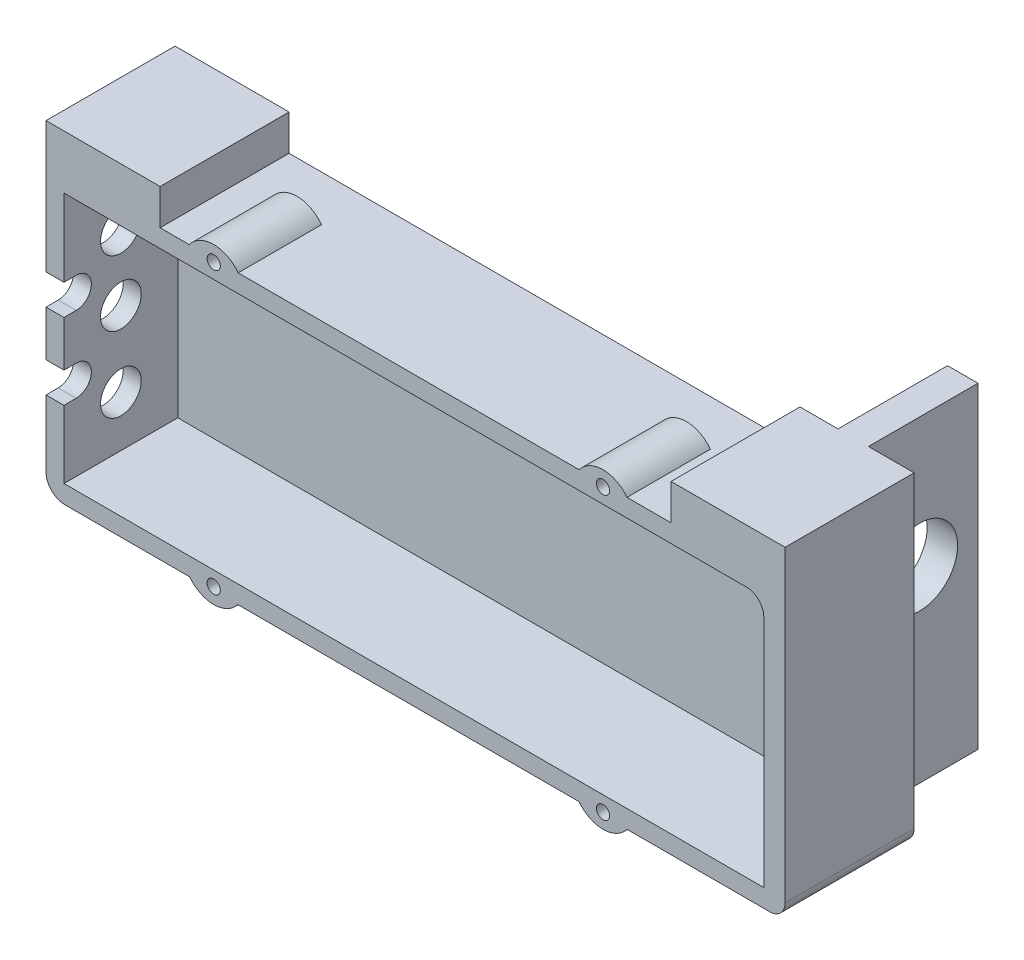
ISO-10303-21;
HEADER;
FILE_DESCRIPTION(('STEP AP214'),'2;1');
FILE_NAME('part.step','',(''),(''),'','','');
FILE_SCHEMA(('AUTOMOTIVE_DESIGN { 1 0 10303 214 1 1 1 1 }'));
ENDSEC;
DATA;
#1=APPLICATION_CONTEXT('core data for automotive mechanical design processes');
#2=APPLICATION_PROTOCOL_DEFINITION('international standard','automotive_design',2000,#1);
#3=PRODUCT_CONTEXT('',#1,'mechanical');
#4=PRODUCT('Part','Part','',(#3));
#5=PRODUCT_RELATED_PRODUCT_CATEGORY('part','',(#4));
#6=PRODUCT_DEFINITION_FORMATION('','',#4);
#7=PRODUCT_DEFINITION_CONTEXT('part definition',#1,'design');
#8=PRODUCT_DEFINITION('design','',#6,#7);
#9=PRODUCT_DEFINITION_SHAPE('','',#8);
#10=(LENGTH_UNIT() NAMED_UNIT(*) SI_UNIT(.MILLI.,.METRE.));
#11=(NAMED_UNIT(*) PLANE_ANGLE_UNIT() SI_UNIT($,.RADIAN.));
#12=(NAMED_UNIT(*) SI_UNIT($,.STERADIAN.) SOLID_ANGLE_UNIT());
#13=UNCERTAINTY_MEASURE_WITH_UNIT(LENGTH_MEASURE(1.E-05),#10,'distance_accuracy_value','');
#14=(GEOMETRIC_REPRESENTATION_CONTEXT(3) GLOBAL_UNCERTAINTY_ASSIGNED_CONTEXT((#13)) GLOBAL_UNIT_ASSIGNED_CONTEXT((#10,
#11,#12)) REPRESENTATION_CONTEXT('',''));
#15=CARTESIAN_POINT('',(0.,0.,0.));
#16=DIRECTION('',(0.,0.,1.));
#17=DIRECTION('',(1.,0.,0.));
#18=AXIS2_PLACEMENT_3D('',#15,#16,#17);
#19=CARTESIAN_POINT('',(0.,0.,-2.54));
#20=DIRECTION('',(0.,0.,-1.));
#21=DIRECTION('',(-1.,0.,0.));
#22=AXIS2_PLACEMENT_3D('',#19,#20,#21);
#23=PLANE('',#22);
#24=DIRECTION('',(-1.,0.,0.));
#25=VECTOR('',#24,1.);
#26=CARTESIAN_POINT('',(48.2280878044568,28.2419999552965,-2.54));
#27=LINE('',#26,#25);
#28=CARTESIAN_POINT('',(48.2280878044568,28.2419999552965,-2.54));
#29=VERTEX_POINT('',#28);
#30=CARTESIAN_POINT('',(1.49208780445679,28.2419999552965,-2.54));
#31=VERTEX_POINT('',#30);
#32=EDGE_CURVE('E448',#29,#31,#27,.T.);
#33=ORIENTED_EDGE('',*,*,#32,.F.);
#34=DIRECTION('',(0.,1.,0.));
#35=VECTOR('',#34,1.);
#36=CARTESIAN_POINT('',(48.2280878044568,28.2419999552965,-2.54));
#37=LINE('',#36,#35);
#38=CARTESIAN_POINT('',(48.2280878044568,-3.00000004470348,-2.54));
#39=VERTEX_POINT('',#38);
#40=EDGE_CURVE('E424',#39,#29,#37,.T.);
#41=ORIENTED_EDGE('',*,*,#40,.F.);
#42=DIRECTION('',(-1.,0.,0.));
#43=VECTOR('',#42,1.);
#44=CARTESIAN_POINT('',(125.000001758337,-3.00000004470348,-2.54));
#45=LINE('',#44,#43);
#46=CARTESIAN_POINT('',(1.49208780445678,-3.00000004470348,-2.54));
#47=VERTEX_POINT('',#46);
#48=EDGE_CURVE('E591',#39,#47,#45,.T.);
#49=ORIENTED_EDGE('',*,*,#48,.T.);
#50=DIRECTION('',(0.,-1.,0.));
#51=VECTOR('',#50,1.);
#52=CARTESIAN_POINT('',(1.49208780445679,28.2419999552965,-2.54));
#53=LINE('',#52,#51);
#54=EDGE_CURVE('E451',#31,#47,#53,.T.);
#55=ORIENTED_EDGE('',*,*,#54,.F.);
#56=EDGE_LOOP('',(#33,#41,#49,#55));
#57=FACE_BOUND('',#56,.T.);
#58=ADVANCED_FACE('F35',(#57),#23,.T.);
#59=CARTESIAN_POINT('',(0.17499995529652,0.174999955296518,-2.54));
#60=DIRECTION('',(0.,0.,-1.));
#61=DIRECTION('',(-1.,0.,0.));
#62=AXIS2_PLACEMENT_3D('',#59,#60,#61);
#63=CIRCLE('',#62,3.175);
#64=CARTESIAN_POINT('',(-0.907927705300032,-2.80960934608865,-2.54));
#65=VERTEX_POINT('',#64);
#66=CARTESIAN_POINT('',(-3.00000004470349,0.174999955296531,-2.54));
#67=VERTEX_POINT('',#66);
#68=EDGE_CURVE('E773',#65,#67,#63,.T.);
#69=ORIENTED_EDGE('',*,*,#68,.T.);
#70=CARTESIAN_POINT('',(0.557676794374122,0.44323862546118,-2.54));
#71=DIRECTION('',(0.,0.,-1.));
#72=DIRECTION('',(1.,0.,0.));
#73=AXIS2_PLACEMENT_3D('',#70,#71,#72);
#74=CIRCLE('',#73,3.56777472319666);
#75=EDGE_CURVE('E454',#65,#67,#74,.T.);
#76=ORIENTED_EDGE('',*,*,#75,.F.);
#77=EDGE_LOOP('',(#69,#76));
#78=FACE_BOUND('',#77,.T.);
#79=ADVANCED_FACE('F900',(#78),#23,.T.);
#80=DIRECTION('',(0.,-1.,0.));
#81=VECTOR('',#80,1.);
#82=CARTESIAN_POINT('',(112.776,-1.98400004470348,-2.54));
#83=LINE('',#82,#81);
#84=CARTESIAN_POINT('',(112.776,50.9749999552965,-2.54));
#85=VERTEX_POINT('',#84);
#86=CARTESIAN_POINT('',(112.776,-1.98400004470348,-2.54));
#87=VERTEX_POINT('',#86);
#88=EDGE_CURVE('E52',#85,#87,#83,.T.);
#89=ORIENTED_EDGE('',*,*,#88,.F.);
#90=DIRECTION('',(1.,0.,0.));
#91=VECTOR('',#90,1.);
#92=CARTESIAN_POINT('',(101.346,50.9749999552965,-2.54));
#93=LINE('',#92,#91);
#94=CARTESIAN_POINT('',(120.396,50.9749999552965,-2.54));
#95=VERTEX_POINT('',#94);
#96=EDGE_CURVE('E394',#85,#95,#93,.T.);
#97=ORIENTED_EDGE('',*,*,#96,.T.);
#98=DIRECTION('',(0.,1.,0.));
#99=VECTOR('',#98,1.);
#100=CARTESIAN_POINT('',(120.396,45.0000006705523,-2.54));
#101=LINE('',#100,#99);
#102=CARTESIAN_POINT('',(120.396,-0.460000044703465,-2.54));
#103=VERTEX_POINT('',#102);
#104=EDGE_CURVE('E541',#103,#95,#101,.T.);
#105=ORIENTED_EDGE('',*,*,#104,.F.);
#106=CARTESIAN_POINT('',(117.856,-0.46000004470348,-2.54));
#107=DIRECTION('',(0.,0.,-1.));
#108=DIRECTION('',(-1.,0.,0.));
#109=AXIS2_PLACEMENT_3D('',#106,#107,#108);
#110=CIRCLE('',#109,2.54);
#111=CARTESIAN_POINT('',(117.856,-3.00000004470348,-2.54));
#112=VERTEX_POINT('',#111);
#113=EDGE_CURVE('E565',#103,#112,#110,.T.);
#114=ORIENTED_EDGE('',*,*,#113,.T.);
#115=CARTESIAN_POINT('',(51.4030878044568,-3.00000004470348,-2.54));
#116=VERTEX_POINT('',#115);
#117=EDGE_CURVE('E586',#112,#116,#45,.T.);
#118=ORIENTED_EDGE('',*,*,#117,.T.);
#119=DIRECTION('',(0.,-1.,0.));
#120=VECTOR('',#119,1.);
#121=CARTESIAN_POINT('',(51.4030878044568,-3.00000004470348,-2.54));
#122=LINE('',#121,#120);
#123=CARTESIAN_POINT('',(51.4030878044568,31.4169999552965,-2.54));
#124=VERTEX_POINT('',#123);
#125=EDGE_CURVE('E431',#124,#116,#122,.T.);
#126=ORIENTED_EDGE('',*,*,#125,.F.);
#127=DIRECTION('',(1.,0.,0.));
#128=VECTOR('',#127,1.);
#129=CARTESIAN_POINT('',(51.4030878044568,31.4169999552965,-2.54));
#130=LINE('',#129,#128);
#131=CARTESIAN_POINT('',(-3.00000004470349,31.4169999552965,-2.54));
#132=VERTEX_POINT('',#131);
#133=EDGE_CURVE('E458',#132,#124,#130,.T.);
#134=ORIENTED_EDGE('',*,*,#133,.F.);
#135=DIRECTION('',(0.,1.,0.));
#136=VECTOR('',#135,1.);
#137=CARTESIAN_POINT('',(-3.00000004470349,45.0000006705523,-2.54));
#138=LINE('',#137,#136);
#139=CARTESIAN_POINT('',(-3.00000004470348,50.9749999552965,-2.54));
#140=VERTEX_POINT('',#139);
#141=EDGE_CURVE('E590',#132,#140,#138,.T.);
#142=ORIENTED_EDGE('',*,*,#141,.T.);
#143=DIRECTION('',(-1.,0.,0.));
#144=VECTOR('',#143,1.);
#145=CARTESIAN_POINT('',(16.0499999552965,50.9749999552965,-2.54));
#146=LINE('',#145,#144);
#147=CARTESIAN_POINT('',(16.0499999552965,50.9749999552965,-2.54000000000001));
#148=VERTEX_POINT('',#147);
#149=EDGE_CURVE('E406',#148,#140,#146,.T.);
#150=ORIENTED_EDGE('',*,*,#149,.F.);
#151=DIRECTION('',(0.,1.,0.));
#152=VECTOR('',#151,1.);
#153=CARTESIAN_POINT('',(16.0499999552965,43.7300006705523,-2.54));
#154=LINE('',#153,#152);
#155=CARTESIAN_POINT('',(16.0499999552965,45.0000006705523,-2.54));
#156=VERTEX_POINT('',#155);
#157=EDGE_CURVE('E402',#156,#148,#154,.T.);
#158=ORIENTED_EDGE('',*,*,#157,.F.);
#159=DIRECTION('',(1.,0.,0.));
#160=VECTOR('',#159,1.);
#161=CARTESIAN_POINT('',(125.000001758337,45.0000006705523,-2.54));
#162=LINE('',#161,#160);
#163=CARTESIAN_POINT('',(101.346,45.0000006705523,-2.54));
#164=VERTEX_POINT('',#163);
#165=EDGE_CURVE('E593',#156,#164,#162,.T.);
#166=ORIENTED_EDGE('',*,*,#165,.T.);
#167=DIRECTION('',(0.,1.,0.));
#168=VECTOR('',#167,1.);
#169=CARTESIAN_POINT('',(101.346,38.2749999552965,-2.54));
#170=LINE('',#169,#168);
#171=CARTESIAN_POINT('',(101.346,50.9749999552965,-2.54));
#172=VERTEX_POINT('',#171);
#173=EDGE_CURVE('E493',#164,#172,#170,.T.);
#174=ORIENTED_EDGE('',*,*,#173,.T.);
#175=CARTESIAN_POINT('',(107.696,50.9749999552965,-2.54));
#176=VERTEX_POINT('',#175);
#177=EDGE_CURVE('E504',#172,#176,#93,.T.);
#178=ORIENTED_EDGE('',*,*,#177,.T.);
#179=DIRECTION('',(0.,-1.,0.));
#180=VECTOR('',#179,1.);
#181=CARTESIAN_POINT('',(107.696,-1.98400004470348,-2.54));
#182=LINE('',#181,#180);
#183=CARTESIAN_POINT('',(107.696,10.7159999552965,-2.54));
#184=VERTEX_POINT('',#183);
#185=EDGE_CURVE('E60',#176,#184,#182,.T.);
#186=ORIENTED_EDGE('',*,*,#185,.T.);
#187=DIRECTION('',(1.,0.,0.));
#188=VECTOR('',#187,1.);
#189=CARTESIAN_POINT('',(107.696,10.7159999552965,-2.54));
#190=LINE('',#189,#188);
#191=CARTESIAN_POINT('',(69.596,10.7159999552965,-2.54));
#192=VERTEX_POINT('',#191);
#193=EDGE_CURVE('E528',#192,#184,#190,.T.);
#194=ORIENTED_EDGE('',*,*,#193,.F.);
#195=DIRECTION('',(0.,1.,0.));
#196=VECTOR('',#195,1.);
#197=CARTESIAN_POINT('',(69.596,10.7159999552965,-2.54));
#198=LINE('',#197,#196);
#199=CARTESIAN_POINT('',(69.596,-1.98400004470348,-2.54));
#200=VERTEX_POINT('',#199);
#201=EDGE_CURVE('E526',#200,#192,#198,.T.);
#202=ORIENTED_EDGE('',*,*,#201,.F.);
#203=DIRECTION('',(-1.,0.,0.));
#204=VECTOR('',#203,1.);
#205=CARTESIAN_POINT('',(107.696,-1.98400004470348,-2.54));
#206=LINE('',#205,#204);
#207=EDGE_CURVE('E515',#87,#200,#206,.T.);
#208=ORIENTED_EDGE('',*,*,#207,.F.);
#209=EDGE_LOOP('',(#89,#97,#105,#114,#118,#126,#134,#142,#150,#158,#166,#174,#178,#186,#194,
#202,#208));
#210=FACE_BOUND('',#209,.T.);
#211=ADVANCED_FACE('F585',(#210),#23,.T.);
#212=CARTESIAN_POINT('',(61.0000008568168,21.0314444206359,19.));
#213=DIRECTION('',(0.,0.,1.));
#214=DIRECTION('',(1.,0.,0.));
#215=AXIS2_PLACEMENT_3D('',#212,#213,#214);
#216=PLANE('',#215);
#217=DIRECTION('',(1.,0.,0.));
#218=VECTOR('',#217,1.);
#219=CARTESIAN_POINT('',(61.0000008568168,11.3100003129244,19.));
#220=LINE('',#219,#218);
#221=CARTESIAN_POINT('',(-3.00000004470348,11.3100003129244,19.));
#222=VERTEX_POINT('',#221);
#223=CARTESIAN_POINT('',(0.,11.3100003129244,19.));
#224=VERTEX_POINT('',#223);
#225=EDGE_CURVE('E785',#222,#224,#220,.T.);
#226=ORIENTED_EDGE('',*,*,#225,.F.);
#227=DIRECTION('',(0.,1.,0.));
#228=VECTOR('',#227,1.);
#229=CARTESIAN_POINT('',(-3.00000004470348,21.0314444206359,19.));
#230=LINE('',#229,#228);
#231=CARTESIAN_POINT('',(-3.00000004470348,0.174999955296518,19.));
#232=VERTEX_POINT('',#231);
#233=EDGE_CURVE('E724',#222,#232,#230,.F.);
#234=ORIENTED_EDGE('',*,*,#233,.T.);
#235=CARTESIAN_POINT('',(0.17499995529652,0.174999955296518,19.));
#236=DIRECTION('',(0.,0.,1.));
#237=DIRECTION('',(1.,0.,0.));
#238=AXIS2_PLACEMENT_3D('',#235,#236,#237);
#239=CIRCLE('',#238,3.175);
#240=CARTESIAN_POINT('',(0.174999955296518,-3.00000004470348,19.));
#241=VERTEX_POINT('',#240);
#242=EDGE_CURVE('E780',#232,#241,#239,.T.);
#243=ORIENTED_EDGE('',*,*,#242,.T.);
#244=DIRECTION('',(1.,0.,0.));
#245=VECTOR('',#244,1.);
#246=CARTESIAN_POINT('',(61.0000008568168,-3.00000004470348,19.));
#247=LINE('',#246,#245);
#248=CARTESIAN_POINT('',(21.0000003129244,-3.00000004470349,19.));
#249=VERTEX_POINT('',#248);
#250=EDGE_CURVE('E680',#241,#249,#247,.T.);
#251=ORIENTED_EDGE('',*,*,#250,.T.);
#252=CARTESIAN_POINT('',(25.000000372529,0.,19.));
#253=DIRECTION('',(0.,0.,1.));
#254=DIRECTION('',(1.,0.,0.));
#255=AXIS2_PLACEMENT_3D('',#252,#253,#254);
#256=CIRCLE('',#255,5.00000007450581);
#257=CARTESIAN_POINT('',(29.0000004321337,-3.00000004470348,19.));
#258=VERTEX_POINT('',#257);
#259=EDGE_CURVE('E714',#249,#258,#256,.T.);
#260=ORIENTED_EDGE('',*,*,#259,.T.);
#261=DIRECTION('',(1.,0.,0.));
#262=VECTOR('',#261,1.);
#263=CARTESIAN_POINT('',(29.0000004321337,-3.00000004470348,19.));
#264=LINE('',#263,#262);
#265=CARTESIAN_POINT('',(86.0000012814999,-3.00000004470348,19.));
#266=VERTEX_POINT('',#265);
#267=EDGE_CURVE('E675',#266,#258,#264,.F.);
#268=ORIENTED_EDGE('',*,*,#267,.F.);
#269=CARTESIAN_POINT('',(90.0000013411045,0.,19.));
#270=DIRECTION('',(0.,0.,1.));
#271=DIRECTION('',(1.,0.,0.));
#272=AXIS2_PLACEMENT_3D('',#269,#270,#271);
#273=CIRCLE('',#272,5.00000007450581);
#274=CARTESIAN_POINT('',(94.0000014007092,-3.00000004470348,19.));
#275=VERTEX_POINT('',#274);
#276=EDGE_CURVE('E700',#266,#275,#273,.T.);
#277=ORIENTED_EDGE('',*,*,#276,.T.);
#278=DIRECTION('',(1.,0.,0.));
#279=VECTOR('',#278,1.);
#280=CARTESIAN_POINT('',(61.0000008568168,-3.00000004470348,19.));
#281=LINE('',#280,#279);
#282=CARTESIAN_POINT('',(117.856,-3.00000004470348,19.));
#283=VERTEX_POINT('',#282);
#284=EDGE_CURVE('E580',#275,#283,#281,.T.);
#285=ORIENTED_EDGE('',*,*,#284,.T.);
#286=CARTESIAN_POINT('',(117.856,-0.46000004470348,19.));
#287=DIRECTION('',(0.,0.,1.));
#288=DIRECTION('',(1.,0.,0.));
#289=AXIS2_PLACEMENT_3D('',#286,#287,#288);
#290=CIRCLE('',#289,2.54);
#291=CARTESIAN_POINT('',(120.396,-0.460000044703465,19.));
#292=VERTEX_POINT('',#291);
#293=EDGE_CURVE('E44',#283,#292,#290,.T.);
#294=ORIENTED_EDGE('',*,*,#293,.T.);
#295=DIRECTION('',(0.,-1.,0.));
#296=VECTOR('',#295,1.);
#297=CARTESIAN_POINT('',(120.396,45.0000006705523,19.));
#298=LINE('',#297,#296);
#299=CARTESIAN_POINT('',(120.396,50.9749999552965,19.));
#300=VERTEX_POINT('',#299);
#301=EDGE_CURVE('E539',#300,#292,#298,.T.);
#302=ORIENTED_EDGE('',*,*,#301,.F.);
#303=DIRECTION('',(1.,0.,0.));
#304=VECTOR('',#303,1.);
#305=CARTESIAN_POINT('',(101.346,50.9749999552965,19.));
#306=LINE('',#305,#304);
#307=CARTESIAN_POINT('',(101.346,50.9749999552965,19.));
#308=VERTEX_POINT('',#307);
#309=EDGE_CURVE('E500',#308,#300,#306,.T.);
#310=ORIENTED_EDGE('',*,*,#309,.F.);
#311=DIRECTION('',(0.,-1.,0.));
#312=VECTOR('',#311,1.);
#313=CARTESIAN_POINT('',(101.346,38.2749999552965,19.));
#314=LINE('',#313,#312);
#315=CARTESIAN_POINT('',(101.346,45.0000006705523,19.));
#316=VERTEX_POINT('',#315);
#317=EDGE_CURVE('E490',#308,#316,#314,.T.);
#318=ORIENTED_EDGE('',*,*,#317,.T.);
#319=DIRECTION('',(1.,0.,0.));
#320=VECTOR('',#319,1.);
#321=CARTESIAN_POINT('',(61.0000008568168,45.0000006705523,19.));
#322=LINE('',#321,#320);
#323=CARTESIAN_POINT('',(94.0000008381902,45.0000006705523,19.));
#324=VERTEX_POINT('',#323);
#325=EDGE_CURVE('E657',#316,#324,#322,.F.);
#326=ORIENTED_EDGE('',*,*,#325,.T.);
#327=CARTESIAN_POINT('',(90.0000013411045,42.,19.));
#328=DIRECTION('',(0.,0.,1.));
#329=DIRECTION('',(1.,0.,0.));
#330=AXIS2_PLACEMENT_3D('',#327,#328,#329);
#331=CIRCLE('',#330,5.);
#332=CARTESIAN_POINT('',(86.0000018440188,45.0000006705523,19.));
#333=VERTEX_POINT('',#332);
#334=EDGE_CURVE('E702',#324,#333,#331,.T.);
#335=ORIENTED_EDGE('',*,*,#334,.T.);
#336=DIRECTION('',(1.,0.,0.));
#337=VECTOR('',#336,1.);
#338=CARTESIAN_POINT('',(61.0000008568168,45.0000006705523,19.));
#339=LINE('',#338,#337);
#340=CARTESIAN_POINT('',(29.0783382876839,45.0000006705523,19.));
#341=VERTEX_POINT('',#340);
#342=EDGE_CURVE('E691',#333,#341,#339,.F.);
#343=ORIENTED_EDGE('',*,*,#342,.T.);
#344=CARTESIAN_POINT('',(25.000000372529,42.,19.));
#345=DIRECTION('',(0.,0.,1.));
#346=DIRECTION('',(1.,0.,0.));
#347=AXIS2_PLACEMENT_3D('',#344,#345,#346);
#348=CIRCLE('',#347,5.06288891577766);
#349=CARTESIAN_POINT('',(20.9216624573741,45.0000006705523,19.));
#350=VERTEX_POINT('',#349);
#351=EDGE_CURVE('E556',#341,#350,#348,.T.);
#352=ORIENTED_EDGE('',*,*,#351,.T.);
#353=DIRECTION('',(1.,0.,0.));
#354=VECTOR('',#353,1.);
#355=CARTESIAN_POINT('',(61.0000008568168,45.0000006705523,19.));
#356=LINE('',#355,#354);
#357=CARTESIAN_POINT('',(16.0499999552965,45.0000006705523,19.));
#358=VERTEX_POINT('',#357);
#359=EDGE_CURVE('E682',#350,#358,#356,.F.);
#360=ORIENTED_EDGE('',*,*,#359,.T.);
#361=DIRECTION('',(0.,1.,0.));
#362=VECTOR('',#361,1.);
#363=CARTESIAN_POINT('',(16.0499999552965,43.7300006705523,19.));
#364=LINE('',#363,#362);
#365=CARTESIAN_POINT('',(16.0499999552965,50.9749999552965,19.));
#366=VERTEX_POINT('',#365);
#367=EDGE_CURVE('E398',#358,#366,#364,.T.);
#368=ORIENTED_EDGE('',*,*,#367,.T.);
#369=DIRECTION('',(-1.,0.,0.));
#370=VECTOR('',#369,1.);
#371=CARTESIAN_POINT('',(16.0499999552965,50.9749999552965,19.));
#372=LINE('',#371,#370);
#373=CARTESIAN_POINT('',(-3.00000004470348,50.9749999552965,19.));
#374=VERTEX_POINT('',#373);
#375=EDGE_CURVE('E399',#366,#374,#372,.T.);
#376=ORIENTED_EDGE('',*,*,#375,.T.);
#377=CARTESIAN_POINT('',(-3.00000004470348,29.0900003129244,19.));
#378=VERTEX_POINT('',#377);
#379=EDGE_CURVE('E725',#374,#378,#230,.F.);
#380=ORIENTED_EDGE('',*,*,#379,.T.);
#381=DIRECTION('',(-1.,0.,0.));
#382=VECTOR('',#381,1.);
#383=CARTESIAN_POINT('',(61.0000008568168,29.0900003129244,19.));
#384=LINE('',#383,#382);
#385=CARTESIAN_POINT('',(0.,29.0900003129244,19.));
#386=VERTEX_POINT('',#385);
#387=EDGE_CURVE('E789',#386,#378,#384,.T.);
#388=ORIENTED_EDGE('',*,*,#387,.F.);
#389=DIRECTION('',(0.,1.,0.));
#390=VECTOR('',#389,1.);
#391=CARTESIAN_POINT('',(0.,0.,19.));
#392=LINE('',#391,#390);
#393=CARTESIAN_POINT('',(0.,42.,19.));
#394=VERTEX_POINT('',#393);
#395=EDGE_CURVE('E557',#394,#386,#392,.F.);
#396=ORIENTED_EDGE('',*,*,#395,.F.);
#397=DIRECTION('',(1.,0.,0.));
#398=VECTOR('',#397,1.);
#399=CARTESIAN_POINT('',(0.,42.,19.));
#400=LINE('',#399,#398);
#401=CARTESIAN_POINT('',(113.996707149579,42.,19.));
#402=VERTEX_POINT('',#401);
#403=EDGE_CURVE('E554',#402,#394,#400,.F.);
#404=ORIENTED_EDGE('',*,*,#403,.F.);
#405=CARTESIAN_POINT('',(113.996707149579,39.1567071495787,19.));
#406=DIRECTION('',(0.,0.,1.));
#407=DIRECTION('',(1.,0.,0.));
#408=AXIS2_PLACEMENT_3D('',#405,#406,#407);
#409=CIRCLE('',#408,2.84329285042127);
#410=CARTESIAN_POINT('',(116.84,39.1567071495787,19.));
#411=VERTEX_POINT('',#410);
#412=EDGE_CURVE('E412',#411,#402,#409,.T.);
#413=ORIENTED_EDGE('',*,*,#412,.F.);
#414=DIRECTION('',(0.,-1.,0.));
#415=VECTOR('',#414,1.);
#416=CARTESIAN_POINT('',(116.84,45.0000006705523,19.));
#417=LINE('',#416,#415);
#418=CARTESIAN_POINT('',(116.84,0.,19.));
#419=VERTEX_POINT('',#418);
#420=EDGE_CURVE('E538',#411,#419,#417,.T.);
#421=ORIENTED_EDGE('',*,*,#420,.T.);
#422=DIRECTION('',(1.,0.,0.));
#423=VECTOR('',#422,1.);
#424=CARTESIAN_POINT('',(61.0000008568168,-4.4703483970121E-08,19.));
#425=LINE('',#424,#423);
#426=CARTESIAN_POINT('',(0.,-2.23517419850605E-08,19.));
#427=VERTEX_POINT('',#426);
#428=EDGE_CURVE('E717',#419,#427,#425,.F.);
#429=ORIENTED_EDGE('',*,*,#428,.T.);
#430=EDGE_CURVE('E721',#224,#427,#392,.F.);
#431=ORIENTED_EDGE('',*,*,#430,.F.);
#432=EDGE_LOOP('',(#226,#234,#243,#251,#260,#268,#277,#285,#294,#302,#310,#318,#326,#335,#343,
#352,#360,#368,#376,#380,#388,#396,#404,#413,#421,#429,#431));
#433=FACE_BOUND('',#432,.T.);
#434=CARTESIAN_POINT('',(25.000000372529,-2.40000002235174,19.));
#435=DIRECTION('',(0.,0.,-1.));
#436=DIRECTION('',(-1.,0.,0.));
#437=AXIS2_PLACEMENT_3D('',#434,#435,#436);
#438=CIRCLE('',#437,1.1);
#439=CARTESIAN_POINT('',(23.900000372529,-2.40000002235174,19.));
#440=VERTEX_POINT('',#439);
#441=EDGE_CURVE('E711',#440,#440,#438,.T.);
#442=ORIENTED_EDGE('',*,*,#441,.T.);
#443=EDGE_LOOP('',(#442));
#444=FACE_BOUND('',#443,.T.);
#445=CARTESIAN_POINT('',(25.000000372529,44.5000006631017,19.));
#446=DIRECTION('',(0.,0.,-1.));
#447=DIRECTION('',(-1.,0.,0.));
#448=AXIS2_PLACEMENT_3D('',#445,#446,#447);
#449=CIRCLE('',#448,1.1);
#450=CARTESIAN_POINT('',(23.900000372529,44.5000006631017,19.));
#451=VERTEX_POINT('',#450);
#452=EDGE_CURVE('E705',#451,#451,#449,.T.);
#453=ORIENTED_EDGE('',*,*,#452,.T.);
#454=EDGE_LOOP('',(#453));
#455=FACE_BOUND('',#454,.T.);
#456=CARTESIAN_POINT('',(90.0000013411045,44.5000006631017,19.));
#457=DIRECTION('',(0.,0.,-1.));
#458=DIRECTION('',(-1.,0.,0.));
#459=AXIS2_PLACEMENT_3D('',#456,#457,#458);
#460=CIRCLE('',#459,1.09999999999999);
#461=CARTESIAN_POINT('',(88.9000013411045,44.5000006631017,19.));
#462=VERTEX_POINT('',#461);
#463=EDGE_CURVE('E708',#462,#462,#460,.T.);
#464=ORIENTED_EDGE('',*,*,#463,.T.);
#465=EDGE_LOOP('',(#464));
#466=FACE_BOUND('',#465,.T.);
#467=CARTESIAN_POINT('',(89.9999979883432,-2.49999994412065,19.));
#468=DIRECTION('',(0.,0.,-1.));
#469=DIRECTION('',(-1.,0.,0.));
#470=AXIS2_PLACEMENT_3D('',#467,#468,#469);
#471=CIRCLE('',#470,1.09999999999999);
#472=CARTESIAN_POINT('',(88.8999979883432,-2.49999994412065,19.));
#473=VERTEX_POINT('',#472);
#474=EDGE_CURVE('E697',#473,#473,#471,.T.);
#475=ORIENTED_EDGE('',*,*,#474,.T.);
#476=EDGE_LOOP('',(#475));
#477=FACE_BOUND('',#476,.T.);
#478=ADVANCED_FACE('F577',(#433,#444,#455,#466,#477),#216,.T.);
#479=CARTESIAN_POINT('',(90.0000013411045,0.,0.));
#480=DIRECTION('',(0.,0.,1.));
#481=DIRECTION('',(1.,0.,0.));
#482=AXIS2_PLACEMENT_3D('',#479,#480,#481);
#483=CYLINDRICAL_SURFACE('',#482,5.00000007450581);
#484=DIRECTION('',(0.,0.,1.));
#485=VECTOR('',#484,1.);
#486=CARTESIAN_POINT('',(86.0000012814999,-3.00000004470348,0.));
#487=LINE('',#486,#485);
#488=CARTESIAN_POINT('',(86.0000012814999,-3.00000004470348,5.08));
#489=VERTEX_POINT('',#488);
#490=EDGE_CURVE('E673',#489,#266,#487,.T.);
#491=ORIENTED_EDGE('',*,*,#490,.F.);
#492=CARTESIAN_POINT('',(90.0000013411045,0.,5.08));
#493=DIRECTION('',(0.,0.,-1.));
#494=DIRECTION('',(-1.,0.,0.));
#495=AXIS2_PLACEMENT_3D('',#492,#493,#494);
#496=CIRCLE('',#495,5.00000007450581);
#497=CARTESIAN_POINT('',(94.0000014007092,-3.00000004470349,5.08));
#498=VERTEX_POINT('',#497);
#499=EDGE_CURVE('E651',#489,#498,#496,.F.);
#500=ORIENTED_EDGE('',*,*,#499,.T.);
#501=DIRECTION('',(0.,0.,1.));
#502=VECTOR('',#501,1.);
#503=CARTESIAN_POINT('',(94.0000014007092,-3.00000004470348,0.));
#504=LINE('',#503,#502);
#505=EDGE_CURVE('E667',#275,#498,#504,.F.);
#506=ORIENTED_EDGE('',*,*,#505,.F.);
#507=ORIENTED_EDGE('',*,*,#276,.F.);
#508=EDGE_LOOP('',(#491,#500,#506,#507));
#509=FACE_BOUND('',#508,.T.);
#510=ADVANCED_FACE('F1017',(#509),#483,.T.);
#511=CARTESIAN_POINT('',(90.0000013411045,42.,0.));
#512=DIRECTION('',(0.,0.,1.));
#513=DIRECTION('',(1.,0.,0.));
#514=AXIS2_PLACEMENT_3D('',#511,#512,#513);
#515=CYLINDRICAL_SURFACE('',#514,5.);
#516=DIRECTION('',(0.,0.,1.));
#517=VECTOR('',#516,1.);
#518=CARTESIAN_POINT('',(94.0000008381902,45.0000006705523,0.));
#519=LINE('',#518,#517);
#520=CARTESIAN_POINT('',(94.0000008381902,45.0000006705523,5.08));
#521=VERTEX_POINT('',#520);
#522=EDGE_CURVE('E654',#324,#521,#519,.F.);
#523=ORIENTED_EDGE('',*,*,#522,.T.);
#524=CARTESIAN_POINT('',(90.0000013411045,42.,5.08));
#525=DIRECTION('',(0.,0.,-1.));
#526=DIRECTION('',(-1.,0.,0.));
#527=AXIS2_PLACEMENT_3D('',#524,#525,#526);
#528=CIRCLE('',#527,5.);
#529=CARTESIAN_POINT('',(86.0000018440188,45.0000006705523,5.08));
#530=VERTEX_POINT('',#529);
#531=EDGE_CURVE('E648',#521,#530,#528,.F.);
#532=ORIENTED_EDGE('',*,*,#531,.T.);
#533=DIRECTION('',(0.,0.,1.));
#534=VECTOR('',#533,1.);
#535=CARTESIAN_POINT('',(86.0000018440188,45.0000006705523,0.));
#536=LINE('',#535,#534);
#537=EDGE_CURVE('E694',#333,#530,#536,.F.);
#538=ORIENTED_EDGE('',*,*,#537,.F.);
#539=ORIENTED_EDGE('',*,*,#334,.F.);
#540=EDGE_LOOP('',(#523,#532,#538,#539));
#541=FACE_BOUND('',#540,.T.);
#542=ADVANCED_FACE('F975',(#541),#515,.T.);
#543=CARTESIAN_POINT('',(25.000000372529,42.,0.));
#544=DIRECTION('',(0.,0.,1.));
#545=DIRECTION('',(1.,0.,0.));
#546=AXIS2_PLACEMENT_3D('',#543,#544,#545);
#547=CYLINDRICAL_SURFACE('',#546,5.06288891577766);
#548=DIRECTION('',(0.,0.,1.));
#549=VECTOR('',#548,1.);
#550=CARTESIAN_POINT('',(29.0783382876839,45.0000006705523,0.));
#551=LINE('',#550,#549);
#552=CARTESIAN_POINT('',(29.0783382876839,45.0000006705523,5.08));
#553=VERTEX_POINT('',#552);
#554=EDGE_CURVE('E688',#341,#553,#551,.F.);
#555=ORIENTED_EDGE('',*,*,#554,.T.);
#556=CARTESIAN_POINT('',(25.000000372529,42.,5.08));
#557=DIRECTION('',(0.,0.,-1.));
#558=DIRECTION('',(-1.,0.,0.));
#559=AXIS2_PLACEMENT_3D('',#556,#557,#558);
#560=CIRCLE('',#559,5.06288891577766);
#561=CARTESIAN_POINT('',(20.9216624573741,45.0000006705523,5.08));
#562=VERTEX_POINT('',#561);
#563=EDGE_CURVE('E645',#553,#562,#560,.F.);
#564=ORIENTED_EDGE('',*,*,#563,.T.);
#565=DIRECTION('',(0.,0.,1.));
#566=VECTOR('',#565,1.);
#567=CARTESIAN_POINT('',(20.9216624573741,45.0000006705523,0.));
#568=LINE('',#567,#566);
#569=EDGE_CURVE('E685',#350,#562,#568,.F.);
#570=ORIENTED_EDGE('',*,*,#569,.F.);
#571=ORIENTED_EDGE('',*,*,#351,.F.);
#572=EDGE_LOOP('',(#555,#564,#570,#571));
#573=FACE_BOUND('',#572,.T.);
#574=ADVANCED_FACE('F944',(#573),#547,.T.);
#575=CARTESIAN_POINT('',(25.000000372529,0.,0.));
#576=DIRECTION('',(0.,0.,1.));
#577=DIRECTION('',(1.,0.,0.));
#578=AXIS2_PLACEMENT_3D('',#575,#576,#577);
#579=CYLINDRICAL_SURFACE('',#578,5.00000007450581);
#580=DIRECTION('',(0.,0.,1.));
#581=VECTOR('',#580,1.);
#582=CARTESIAN_POINT('',(21.0000003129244,-3.0000000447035,0.));
#583=LINE('',#582,#581);
#584=CARTESIAN_POINT('',(21.0000003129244,-3.0000000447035,5.08));
#585=VERTEX_POINT('',#584);
#586=EDGE_CURVE('E677',#249,#585,#583,.F.);
#587=ORIENTED_EDGE('',*,*,#586,.T.);
#588=CARTESIAN_POINT('',(25.000000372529,0.,5.08));
#589=DIRECTION('',(0.,0.,-1.));
#590=DIRECTION('',(-1.,0.,0.));
#591=AXIS2_PLACEMENT_3D('',#588,#589,#590);
#592=CIRCLE('',#591,5.00000007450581);
#593=CARTESIAN_POINT('',(29.0000004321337,-3.00000004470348,5.08));
#594=VERTEX_POINT('',#593);
#595=EDGE_CURVE('E642',#585,#594,#592,.F.);
#596=ORIENTED_EDGE('',*,*,#595,.T.);
#597=DIRECTION('',(0.,0.,1.));
#598=VECTOR('',#597,1.);
#599=CARTESIAN_POINT('',(29.0000004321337,-3.00000004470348,0.));
#600=LINE('',#599,#598);
#601=EDGE_CURVE('E670',#258,#594,#600,.F.);
#602=ORIENTED_EDGE('',*,*,#601,.F.);
#603=ORIENTED_EDGE('',*,*,#259,.F.);
#604=EDGE_LOOP('',(#587,#596,#602,#603));
#605=FACE_BOUND('',#604,.T.);
#606=ADVANCED_FACE('F1049',(#605),#579,.T.);
#607=CARTESIAN_POINT('',(89.9999979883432,-2.49999994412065,4.));
#608=DIRECTION('',(0.,0.,1.));
#609=DIRECTION('',(1.,0.,0.));
#610=AXIS2_PLACEMENT_3D('',#607,#608,#609);
#611=PLANE('',#610);
#612=CARTESIAN_POINT('',(89.9999979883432,-2.49999994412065,4.));
#613=DIRECTION('',(0.,0.,-1.));
#614=DIRECTION('',(-1.,0.,0.));
#615=AXIS2_PLACEMENT_3D('',#612,#613,#614);
#616=CIRCLE('',#615,1.09999999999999);
#617=CARTESIAN_POINT('',(90.979793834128,-3.00000004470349,4.));
#618=VERTEX_POINT('',#617);
#619=CARTESIAN_POINT('',(89.0202021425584,-3.00000004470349,4.));
#620=VERTEX_POINT('',#619);
#621=EDGE_CURVE('E752',#618,#620,#616,.F.);
#622=ORIENTED_EDGE('',*,*,#621,.T.);
#623=DIRECTION('',(1.,0.,0.));
#624=VECTOR('',#623,1.);
#625=CARTESIAN_POINT('',(89.9999979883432,-3.00000004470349,4.));
#626=LINE('',#625,#624);
#627=EDGE_CURVE('E618',#620,#618,#626,.T.);
#628=ORIENTED_EDGE('',*,*,#627,.T.);
#629=EDGE_LOOP('',(#622,#628));
#630=FACE_BOUND('',#629,.T.);
#631=ADVANCED_FACE('F1045',(#630),#611,.T.);
#632=CARTESIAN_POINT('',(89.9999979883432,-2.49999994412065,19.));
#633=DIRECTION('',(0.,0.,-1.));
#634=DIRECTION('',(-1.,0.,0.));
#635=AXIS2_PLACEMENT_3D('',#632,#633,#634);
#636=CYLINDRICAL_SURFACE('',#635,1.09999999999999);
#637=ORIENTED_EDGE('',*,*,#474,.F.);
#638=EDGE_LOOP('',(#637));
#639=FACE_BOUND('',#638,.T.);
#640=DIRECTION('',(0.,0.,-1.));
#641=VECTOR('',#640,1.);
#642=CARTESIAN_POINT('',(89.0202021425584,-3.00000004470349,19.));
#643=LINE('',#642,#641);
#644=CARTESIAN_POINT('',(89.0202021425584,-3.00000004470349,5.08));
#645=VERTEX_POINT('',#644);
#646=EDGE_CURVE('E621',#620,#645,#643,.F.);
#647=ORIENTED_EDGE('',*,*,#646,.F.);
#648=ORIENTED_EDGE('',*,*,#621,.F.);
#649=DIRECTION('',(0.,0.,-1.));
#650=VECTOR('',#649,1.);
#651=CARTESIAN_POINT('',(90.979793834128,-3.00000004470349,19.));
#652=LINE('',#651,#650);
#653=CARTESIAN_POINT('',(90.979793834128,-3.00000004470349,5.08));
#654=VERTEX_POINT('',#653);
#655=EDGE_CURVE('E616',#654,#618,#652,.T.);
#656=ORIENTED_EDGE('',*,*,#655,.F.);
#657=CARTESIAN_POINT('',(89.9999979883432,-2.49999994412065,5.08));
#658=DIRECTION('',(0.,0.,-1.));
#659=DIRECTION('',(-1.,0.,0.));
#660=AXIS2_PLACEMENT_3D('',#657,#658,#659);
#661=CIRCLE('',#660,1.09999999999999);
#662=EDGE_CURVE('E639',#645,#654,#661,.F.);
#663=ORIENTED_EDGE('',*,*,#662,.F.);
#664=EDGE_LOOP('',(#647,#648,#656,#663));
#665=FACE_BOUND('',#664,.T.);
#666=ADVANCED_FACE('F1048',(#639,#665),#636,.F.);
#667=CARTESIAN_POINT('',(25.000000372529,-2.40000002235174,4.));
#668=DIRECTION('',(0.,0.,1.));
#669=DIRECTION('',(1.,0.,0.));
#670=AXIS2_PLACEMENT_3D('',#667,#668,#669);
#671=PLANE('',#670);
#672=CARTESIAN_POINT('',(25.000000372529,-2.40000002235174,4.));
#673=DIRECTION('',(0.,0.,-1.));
#674=DIRECTION('',(-1.,0.,0.));
#675=AXIS2_PLACEMENT_3D('',#672,#673,#674);
#676=CIRCLE('',#675,1.1);
#677=CARTESIAN_POINT('',(25.921954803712,-3.00000004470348,4.));
#678=VERTEX_POINT('',#677);
#679=CARTESIAN_POINT('',(24.078045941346,-3.00000004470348,4.));
#680=VERTEX_POINT('',#679);
#681=EDGE_CURVE('E755',#678,#680,#676,.F.);
#682=ORIENTED_EDGE('',*,*,#681,.T.);
#683=DIRECTION('',(1.,0.,0.));
#684=VECTOR('',#683,1.);
#685=CARTESIAN_POINT('',(25.000000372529,-3.00000004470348,4.));
#686=LINE('',#685,#684);
#687=EDGE_CURVE('E611',#680,#678,#686,.T.);
#688=ORIENTED_EDGE('',*,*,#687,.T.);
#689=EDGE_LOOP('',(#682,#688));
#690=FACE_BOUND('',#689,.T.);
#691=ADVANCED_FACE('F1053',(#690),#671,.T.);
#692=CARTESIAN_POINT('',(90.0000013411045,44.5000006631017,4.));
#693=DIRECTION('',(0.,0.,1.));
#694=DIRECTION('',(1.,0.,0.));
#695=AXIS2_PLACEMENT_3D('',#692,#693,#694);
#696=PLANE('',#695);
#697=CARTESIAN_POINT('',(90.0000013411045,44.5000006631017,4.));
#698=DIRECTION('',(0.,0.,-1.));
#699=DIRECTION('',(-1.,0.,0.));
#700=AXIS2_PLACEMENT_3D('',#697,#698,#699);
#701=CIRCLE('',#700,1.09999999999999);
#702=CARTESIAN_POINT('',(89.0202054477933,45.0000006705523,4.));
#703=VERTEX_POINT('',#702);
#704=CARTESIAN_POINT('',(90.9797972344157,45.0000006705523,4.));
#705=VERTEX_POINT('',#704);
#706=EDGE_CURVE('E758',#703,#705,#701,.F.);
#707=ORIENTED_EDGE('',*,*,#706,.T.);
#708=DIRECTION('',(-1.,0.,0.));
#709=VECTOR('',#708,1.);
#710=CARTESIAN_POINT('',(90.0000013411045,45.0000006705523,4.));
#711=LINE('',#710,#709);
#712=EDGE_CURVE('E628',#705,#703,#711,.T.);
#713=ORIENTED_EDGE('',*,*,#712,.T.);
#714=EDGE_LOOP('',(#707,#713));
#715=FACE_BOUND('',#714,.T.);
#716=ADVANCED_FACE('F970',(#715),#696,.T.);
#717=CARTESIAN_POINT('',(25.000000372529,44.5000006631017,4.));
#718=DIRECTION('',(0.,0.,1.));
#719=DIRECTION('',(1.,0.,0.));
#720=AXIS2_PLACEMENT_3D('',#717,#718,#719);
#721=PLANE('',#720);
#722=CARTESIAN_POINT('',(25.000000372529,44.5000006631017,4.));
#723=DIRECTION('',(0.,0.,-1.));
#724=DIRECTION('',(-1.,0.,0.));
#725=AXIS2_PLACEMENT_3D('',#722,#723,#724);
#726=CIRCLE('',#725,1.1);
#727=CARTESIAN_POINT('',(24.0202044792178,45.0000006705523,4.));
#728=VERTEX_POINT('',#727);
#729=CARTESIAN_POINT('',(25.9797962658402,45.0000006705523,4.));
#730=VERTEX_POINT('',#729);
#731=EDGE_CURVE('E761',#728,#730,#726,.F.);
#732=ORIENTED_EDGE('',*,*,#731,.T.);
#733=DIRECTION('',(-1.,0.,0.));
#734=VECTOR('',#733,1.);
#735=CARTESIAN_POINT('',(25.000000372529,45.0000006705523,4.));
#736=LINE('',#735,#734);
#737=EDGE_CURVE('E623',#730,#728,#736,.T.);
#738=ORIENTED_EDGE('',*,*,#737,.T.);
#739=EDGE_LOOP('',(#732,#738));
#740=FACE_BOUND('',#739,.T.);
#741=ADVANCED_FACE('F957',(#740),#721,.T.);
#742=CARTESIAN_POINT('',(25.000000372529,-2.40000002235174,19.));
#743=DIRECTION('',(0.,0.,-1.));
#744=DIRECTION('',(-1.,0.,0.));
#745=AXIS2_PLACEMENT_3D('',#742,#743,#744);
#746=CYLINDRICAL_SURFACE('',#745,1.1);
#747=ORIENTED_EDGE('',*,*,#441,.F.);
#748=EDGE_LOOP('',(#747));
#749=FACE_BOUND('',#748,.T.);
#750=DIRECTION('',(0.,0.,-1.));
#751=VECTOR('',#750,1.);
#752=CARTESIAN_POINT('',(24.078045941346,-3.00000004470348,19.));
#753=LINE('',#752,#751);
#754=CARTESIAN_POINT('',(24.078045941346,-3.00000004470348,5.08));
#755=VERTEX_POINT('',#754);
#756=EDGE_CURVE('E614',#680,#755,#753,.F.);
#757=ORIENTED_EDGE('',*,*,#756,.F.);
#758=ORIENTED_EDGE('',*,*,#681,.F.);
#759=DIRECTION('',(0.,0.,-1.));
#760=VECTOR('',#759,1.);
#761=CARTESIAN_POINT('',(25.921954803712,-3.00000004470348,19.));
#762=LINE('',#761,#760);
#763=CARTESIAN_POINT('',(25.921954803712,-3.00000004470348,5.08));
#764=VERTEX_POINT('',#763);
#765=EDGE_CURVE('E609',#764,#678,#762,.T.);
#766=ORIENTED_EDGE('',*,*,#765,.F.);
#767=CARTESIAN_POINT('',(25.000000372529,-2.40000002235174,5.08));
#768=DIRECTION('',(0.,0.,-1.));
#769=DIRECTION('',(-1.,0.,0.));
#770=AXIS2_PLACEMENT_3D('',#767,#768,#769);
#771=CIRCLE('',#770,1.1);
#772=EDGE_CURVE('E636',#755,#764,#771,.F.);
#773=ORIENTED_EDGE('',*,*,#772,.F.);
#774=EDGE_LOOP('',(#757,#758,#766,#773));
#775=FACE_BOUND('',#774,.T.);
#776=ADVANCED_FACE('F1060',(#749,#775),#746,.F.);
#777=CARTESIAN_POINT('',(90.0000013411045,44.5000006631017,19.));
#778=DIRECTION('',(0.,0.,-1.));
#779=DIRECTION('',(-1.,0.,0.));
#780=AXIS2_PLACEMENT_3D('',#777,#778,#779);
#781=CYLINDRICAL_SURFACE('',#780,1.09999999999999);
#782=ORIENTED_EDGE('',*,*,#463,.F.);
#783=EDGE_LOOP('',(#782));
#784=FACE_BOUND('',#783,.T.);
#785=DIRECTION('',(0.,0.,-1.));
#786=VECTOR('',#785,1.);
#787=CARTESIAN_POINT('',(90.9797972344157,45.0000006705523,19.));
#788=LINE('',#787,#786);
#789=CARTESIAN_POINT('',(90.9797972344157,45.0000006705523,5.08));
#790=VERTEX_POINT('',#789);
#791=EDGE_CURVE('E631',#705,#790,#788,.F.);
#792=ORIENTED_EDGE('',*,*,#791,.F.);
#793=ORIENTED_EDGE('',*,*,#706,.F.);
#794=DIRECTION('',(0.,0.,-1.));
#795=VECTOR('',#794,1.);
#796=CARTESIAN_POINT('',(89.0202054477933,45.0000006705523,19.));
#797=LINE('',#796,#795);
#798=CARTESIAN_POINT('',(89.0202054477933,45.0000006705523,5.08));
#799=VERTEX_POINT('',#798);
#800=EDGE_CURVE('E626',#799,#703,#797,.T.);
#801=ORIENTED_EDGE('',*,*,#800,.F.);
#802=CARTESIAN_POINT('',(90.0000013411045,44.5000006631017,5.08));
#803=DIRECTION('',(0.,0.,-1.));
#804=DIRECTION('',(-1.,0.,0.));
#805=AXIS2_PLACEMENT_3D('',#802,#803,#804);
#806=CIRCLE('',#805,1.09999999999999);
#807=EDGE_CURVE('E633',#790,#799,#806,.F.);
#808=ORIENTED_EDGE('',*,*,#807,.F.);
#809=EDGE_LOOP('',(#792,#793,#801,#808));
#810=FACE_BOUND('',#809,.T.);
#811=ADVANCED_FACE('F968',(#784,#810),#781,.F.);
#812=CARTESIAN_POINT('',(25.000000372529,44.5000006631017,19.));
#813=DIRECTION('',(0.,0.,-1.));
#814=DIRECTION('',(-1.,0.,0.));
#815=AXIS2_PLACEMENT_3D('',#812,#813,#814);
#816=CYLINDRICAL_SURFACE('',#815,1.1);
#817=ORIENTED_EDGE('',*,*,#452,.F.);
#818=EDGE_LOOP('',(#817));
#819=FACE_BOUND('',#818,.T.);
#820=DIRECTION('',(0.,0.,-1.));
#821=VECTOR('',#820,1.);
#822=CARTESIAN_POINT('',(25.9797962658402,45.0000006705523,19.));
#823=LINE('',#822,#821);
#824=CARTESIAN_POINT('',(25.9797962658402,45.0000006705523,5.08));
#825=VERTEX_POINT('',#824);
#826=EDGE_CURVE('E769',#730,#825,#823,.F.);
#827=ORIENTED_EDGE('',*,*,#826,.F.);
#828=ORIENTED_EDGE('',*,*,#731,.F.);
#829=DIRECTION('',(0.,0.,-1.));
#830=VECTOR('',#829,1.);
#831=CARTESIAN_POINT('',(24.0202044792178,45.0000006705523,19.));
#832=LINE('',#831,#830);
#833=CARTESIAN_POINT('',(24.0202044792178,45.0000006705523,5.08));
#834=VERTEX_POINT('',#833);
#835=EDGE_CURVE('E764',#834,#728,#832,.T.);
#836=ORIENTED_EDGE('',*,*,#835,.F.);
#837=CARTESIAN_POINT('',(25.000000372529,44.5000006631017,5.08));
#838=DIRECTION('',(0.,0.,-1.));
#839=DIRECTION('',(-1.,0.,0.));
#840=AXIS2_PLACEMENT_3D('',#837,#838,#839);
#841=CIRCLE('',#840,1.1);
#842=EDGE_CURVE('E766',#825,#834,#841,.F.);
#843=ORIENTED_EDGE('',*,*,#842,.F.);
#844=EDGE_LOOP('',(#827,#828,#836,#843));
#845=FACE_BOUND('',#844,.T.);
#846=ADVANCED_FACE('F955',(#819,#845),#816,.F.);
#847=CARTESIAN_POINT('',(-3.00000004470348,-3.00000004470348,0.));
#848=DIRECTION('',(0.,-1.,0.));
#849=DIRECTION('',(0.,0.,-1.));
#850=AXIS2_PLACEMENT_3D('',#847,#848,#849);
#851=PLANE('',#850);
#852=ORIENTED_EDGE('',*,*,#267,.T.);
#853=ORIENTED_EDGE('',*,*,#601,.T.);
#854=DIRECTION('',(-1.,0.,0.));
#855=VECTOR('',#854,1.);
#856=CARTESIAN_POINT('',(-3.00000004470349,-3.00000004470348,5.08));
#857=LINE('',#856,#855);
#858=EDGE_CURVE('E607',#594,#764,#857,.T.);
#859=ORIENTED_EDGE('',*,*,#858,.T.);
#860=ORIENTED_EDGE('',*,*,#765,.T.);
#861=ORIENTED_EDGE('',*,*,#687,.F.);
#862=ORIENTED_EDGE('',*,*,#756,.T.);
#863=EDGE_CURVE('E605',#755,#585,#857,.T.);
#864=ORIENTED_EDGE('',*,*,#863,.T.);
#865=ORIENTED_EDGE('',*,*,#586,.F.);
#866=ORIENTED_EDGE('',*,*,#250,.F.);
#867=DIRECTION('',(0.,0.,1.));
#868=VECTOR('',#867,1.);
#869=CARTESIAN_POINT('',(0.17499995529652,-3.00000004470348,0.));
#870=LINE('',#869,#868);
#871=CARTESIAN_POINT('',(0.174999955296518,-3.00000004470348,-2.54));
#872=VERTEX_POINT('',#871);
#873=EDGE_CURVE('E771',#241,#872,#870,.F.);
#874=ORIENTED_EDGE('',*,*,#873,.T.);
#875=DIRECTION('',(-1.,0.,0.));
#876=VECTOR('',#875,1.);
#877=CARTESIAN_POINT('',(-3.00000004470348,-3.00000004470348,-2.54));
#878=LINE('',#877,#876);
#879=EDGE_CURVE('E486',#47,#872,#878,.T.);
#880=ORIENTED_EDGE('',*,*,#879,.F.);
#881=ORIENTED_EDGE('',*,*,#48,.F.);
#882=DIRECTION('',(0.,0.,1.));
#883=VECTOR('',#882,1.);
#884=CARTESIAN_POINT('',(48.2280878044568,-3.00000004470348,-15.24));
#885=LINE('',#884,#883);
#886=CARTESIAN_POINT('',(48.2280878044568,-3.00000004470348,-15.24));
#887=VERTEX_POINT('',#886);
#888=EDGE_CURVE('E445',#887,#39,#885,.T.);
#889=ORIENTED_EDGE('',*,*,#888,.F.);
#890=DIRECTION('',(-1.,0.,0.));
#891=VECTOR('',#890,1.);
#892=CARTESIAN_POINT('',(48.2280878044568,-3.00000004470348,-15.24));
#893=LINE('',#892,#891);
#894=CARTESIAN_POINT('',(51.4030878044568,-3.00000004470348,-15.24));
#895=VERTEX_POINT('',#894);
#896=EDGE_CURVE('E443',#895,#887,#893,.T.);
#897=ORIENTED_EDGE('',*,*,#896,.F.);
#898=DIRECTION('',(0.,0.,1.));
#899=VECTOR('',#898,1.);
#900=CARTESIAN_POINT('',(51.4030878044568,-3.00000004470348,-15.24));
#901=LINE('',#900,#899);
#902=EDGE_CURVE('E465',#895,#116,#901,.T.);
#903=ORIENTED_EDGE('',*,*,#902,.T.);
#904=ORIENTED_EDGE('',*,*,#117,.F.);
#905=DIRECTION('',(0.,0.,-1.));
#906=VECTOR('',#905,1.);
#907=CARTESIAN_POINT('',(117.856,-3.00000004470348,0.));
#908=LINE('',#907,#906);
#909=EDGE_CURVE('E567',#112,#283,#908,.F.);
#910=ORIENTED_EDGE('',*,*,#909,.T.);
#911=ORIENTED_EDGE('',*,*,#284,.F.);
#912=ORIENTED_EDGE('',*,*,#505,.T.);
#913=EDGE_CURVE('E608',#498,#654,#857,.T.);
#914=ORIENTED_EDGE('',*,*,#913,.T.);
#915=ORIENTED_EDGE('',*,*,#655,.T.);
#916=ORIENTED_EDGE('',*,*,#627,.F.);
#917=ORIENTED_EDGE('',*,*,#646,.T.);
#918=EDGE_CURVE('E1649',#645,#489,#857,.T.);
#919=ORIENTED_EDGE('',*,*,#918,.T.);
#920=ORIENTED_EDGE('',*,*,#490,.T.);
#921=EDGE_LOOP('',(#852,#853,#859,#860,#861,#862,#864,#865,#866,#874,#880,#881,#889,#897,#903,
#904,#910,#911,#912,#914,#915,#916,#917,#919,#920));
#922=FACE_BOUND('',#921,.T.);
#923=ADVANCED_FACE('F587',(#922),#851,.T.);
#924=CARTESIAN_POINT('',(86.0000018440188,45.0000006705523,0.));
#925=DIRECTION('',(0.,1.,0.));
#926=DIRECTION('',(0.,0.,1.));
#927=AXIS2_PLACEMENT_3D('',#924,#925,#926);
#928=PLANE('',#927);
#929=DIRECTION('',(0.,0.,-1.));
#930=VECTOR('',#929,1.);
#931=CARTESIAN_POINT('',(16.0499999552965,45.0000006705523,0.));
#932=LINE('',#931,#930);
#933=EDGE_CURVE('E11',#358,#156,#932,.T.);
#934=ORIENTED_EDGE('',*,*,#933,.F.);
#935=ORIENTED_EDGE('',*,*,#359,.F.);
#936=ORIENTED_EDGE('',*,*,#569,.T.);
#937=DIRECTION('',(1.,0.,0.));
#938=VECTOR('',#937,1.);
#939=CARTESIAN_POINT('',(-3.00000004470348,45.0000006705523,5.08));
#940=LINE('',#939,#938);
#941=EDGE_CURVE('E604',#562,#834,#940,.T.);
#942=ORIENTED_EDGE('',*,*,#941,.T.);
#943=ORIENTED_EDGE('',*,*,#835,.T.);
#944=ORIENTED_EDGE('',*,*,#737,.F.);
#945=ORIENTED_EDGE('',*,*,#826,.T.);
#946=EDGE_CURVE('E948',#825,#553,#940,.T.);
#947=ORIENTED_EDGE('',*,*,#946,.T.);
#948=ORIENTED_EDGE('',*,*,#554,.F.);
#949=ORIENTED_EDGE('',*,*,#342,.F.);
#950=ORIENTED_EDGE('',*,*,#537,.T.);
#951=EDGE_CURVE('E603',#530,#799,#940,.T.);
#952=ORIENTED_EDGE('',*,*,#951,.T.);
#953=ORIENTED_EDGE('',*,*,#800,.T.);
#954=ORIENTED_EDGE('',*,*,#712,.F.);
#955=ORIENTED_EDGE('',*,*,#791,.T.);
#956=EDGE_CURVE('E601',#790,#521,#940,.T.);
#957=ORIENTED_EDGE('',*,*,#956,.T.);
#958=ORIENTED_EDGE('',*,*,#522,.F.);
#959=ORIENTED_EDGE('',*,*,#325,.F.);
#960=DIRECTION('',(0.,0.,1.));
#961=VECTOR('',#960,1.);
#962=CARTESIAN_POINT('',(101.346,45.0000006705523,0.));
#963=LINE('',#962,#961);
#964=EDGE_CURVE('E503',#164,#316,#963,.T.);
#965=ORIENTED_EDGE('',*,*,#964,.F.);
#966=ORIENTED_EDGE('',*,*,#165,.F.);
#967=EDGE_LOOP('',(#934,#935,#936,#942,#943,#944,#945,#947,#948,#949,#950,#952,#953,#954,#955,
#957,#958,#959,#965,#966));
#968=FACE_BOUND('',#967,.T.);
#969=ADVANCED_FACE('F939',(#968),#928,.T.);
#970=CARTESIAN_POINT('',(122.,0.,0.));
#971=DIRECTION('',(0.,1.,0.));
#972=DIRECTION('',(0.,0.,1.));
#973=AXIS2_PLACEMENT_3D('',#970,#971,#972);
#974=PLANE('',#973);
#975=ORIENTED_EDGE('',*,*,#428,.F.);
#976=DIRECTION('',(0.,0.,1.));
#977=VECTOR('',#976,1.);
#978=CARTESIAN_POINT('',(116.84,0.,0.));
#979=LINE('',#978,#977);
#980=CARTESIAN_POINT('',(116.84,0.,0.));
#981=VERTEX_POINT('',#980);
#982=EDGE_CURVE('E544',#981,#419,#979,.T.);
#983=ORIENTED_EDGE('',*,*,#982,.F.);
#984=DIRECTION('',(1.,0.,0.));
#985=VECTOR('',#984,1.);
#986=CARTESIAN_POINT('',(61.0000008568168,0.,0.));
#987=LINE('',#986,#985);
#988=CARTESIAN_POINT('',(0.,0.,0.));
#989=VERTEX_POINT('',#988);
#990=EDGE_CURVE('E659',#981,#989,#987,.F.);
#991=ORIENTED_EDGE('',*,*,#990,.T.);
#992=DIRECTION('',(0.,0.,-1.));
#993=VECTOR('',#992,1.);
#994=CARTESIAN_POINT('',(0.,0.,0.));
#995=LINE('',#994,#993);
#996=EDGE_CURVE('E727',#427,#989,#995,.T.);
#997=ORIENTED_EDGE('',*,*,#996,.F.);
#998=EDGE_LOOP('',(#975,#983,#991,#997));
#999=FACE_BOUND('',#998,.T.);
#1000=ADVANCED_FACE('F819',(#999),#974,.T.);
#1001=CARTESIAN_POINT('',(0.,42.,0.));
#1002=DIRECTION('',(0.,-1.,0.));
#1003=DIRECTION('',(1.,0.,0.));
#1004=AXIS2_PLACEMENT_3D('',#1001,#1002,#1003);
#1005=PLANE('',#1004);
#1006=DIRECTION('',(1.,0.,0.));
#1007=VECTOR('',#1006,1.);
#1008=CARTESIAN_POINT('',(0.,42.,0.));
#1009=LINE('',#1008,#1007);
#1010=CARTESIAN_POINT('',(0.,42.,0.));
#1011=VERTEX_POINT('',#1010);
#1012=CARTESIAN_POINT('',(113.996707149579,42.,0.));
#1013=VERTEX_POINT('',#1012);
#1014=EDGE_CURVE('E661',#1011,#1013,#1009,.T.);
#1015=ORIENTED_EDGE('',*,*,#1014,.T.);
#1016=DIRECTION('',(0.,0.,1.));
#1017=VECTOR('',#1016,1.);
#1018=CARTESIAN_POINT('',(113.996707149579,42.,-15.9354843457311));
#1019=LINE('',#1018,#1017);
#1020=EDGE_CURVE('E421',#1013,#402,#1019,.T.);
#1021=ORIENTED_EDGE('',*,*,#1020,.T.);
#1022=ORIENTED_EDGE('',*,*,#403,.T.);
#1023=DIRECTION('',(0.,0.,1.));
#1024=VECTOR('',#1023,1.);
#1025=CARTESIAN_POINT('',(0.,42.,0.));
#1026=LINE('',#1025,#1024);
#1027=EDGE_CURVE('E731',#394,#1011,#1026,.F.);
#1028=ORIENTED_EDGE('',*,*,#1027,.T.);
#1029=EDGE_LOOP('',(#1015,#1021,#1022,#1028));
#1030=FACE_BOUND('',#1029,.T.);
#1031=ADVANCED_FACE('F812',(#1030),#1005,.T.);
#1032=CARTESIAN_POINT('',(0.,0.,0.));
#1033=DIRECTION('',(1.,0.,0.));
#1034=DIRECTION('',(0.,0.,-1.));
#1035=AXIS2_PLACEMENT_3D('',#1032,#1033,#1034);
#1036=PLANE('',#1035);
#1037=DIRECTION('',(0.,0.,1.));
#1038=VECTOR('',#1037,1.);
#1039=CARTESIAN_POINT('',(0.,29.0900003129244,0.));
#1040=LINE('',#1039,#1038);
#1041=CARTESIAN_POINT('',(0.,29.0900003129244,16.968));
#1042=VERTEX_POINT('',#1041);
#1043=EDGE_CURVE('E838',#1042,#386,#1040,.T.);
#1044=ORIENTED_EDGE('',*,*,#1043,.F.);
#1045=CARTESIAN_POINT('',(0.,26.5500003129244,16.968));
#1046=DIRECTION('',(1.,0.,0.));
#1047=DIRECTION('',(0.,0.,-1.));
#1048=AXIS2_PLACEMENT_3D('',#1045,#1046,#1047);
#1049=CIRCLE('',#1048,2.54);
#1050=CARTESIAN_POINT('',(0.,24.0100003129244,16.968));
#1051=VERTEX_POINT('',#1050);
#1052=EDGE_CURVE('E840',#1051,#1042,#1049,.T.);
#1053=ORIENTED_EDGE('',*,*,#1052,.F.);
#1054=DIRECTION('',(0.,0.,-1.));
#1055=VECTOR('',#1054,1.);
#1056=CARTESIAN_POINT('',(0.,24.0100003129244,0.));
#1057=LINE('',#1056,#1055);
#1058=CARTESIAN_POINT('',(0.,24.0100003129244,19.));
#1059=VERTEX_POINT('',#1058);
#1060=EDGE_CURVE('E835',#1059,#1051,#1057,.T.);
#1061=ORIENTED_EDGE('',*,*,#1060,.F.);
#1062=CARTESIAN_POINT('',(0.,16.3900003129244,19.));
#1063=VERTEX_POINT('',#1062);
#1064=EDGE_CURVE('E720',#1059,#1063,#392,.F.);
#1065=ORIENTED_EDGE('',*,*,#1064,.T.);
#1066=DIRECTION('',(0.,0.,1.));
#1067=VECTOR('',#1066,1.);
#1068=CARTESIAN_POINT('',(0.,16.3900003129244,0.));
#1069=LINE('',#1068,#1067);
#1070=CARTESIAN_POINT('',(0.,16.3900003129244,16.968));
#1071=VERTEX_POINT('',#1070);
#1072=EDGE_CURVE('E853',#1071,#1063,#1069,.T.);
#1073=ORIENTED_EDGE('',*,*,#1072,.F.);
#1074=CARTESIAN_POINT('',(0.,13.8500003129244,16.968));
#1075=DIRECTION('',(1.,0.,0.));
#1076=DIRECTION('',(0.,0.,-1.));
#1077=AXIS2_PLACEMENT_3D('',#1074,#1075,#1076);
#1078=CIRCLE('',#1077,2.54);
#1079=CARTESIAN_POINT('',(0.,11.3100003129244,16.968));
#1080=VERTEX_POINT('',#1079);
#1081=EDGE_CURVE('E596',#1080,#1071,#1078,.T.);
#1082=ORIENTED_EDGE('',*,*,#1081,.F.);
#1083=DIRECTION('',(0.,0.,-1.));
#1084=VECTOR('',#1083,1.);
#1085=CARTESIAN_POINT('',(0.,11.3100003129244,0.));
#1086=LINE('',#1085,#1084);
#1087=EDGE_CURVE('E856',#224,#1080,#1086,.T.);
#1088=ORIENTED_EDGE('',*,*,#1087,.F.);
#1089=ORIENTED_EDGE('',*,*,#430,.T.);
#1090=ORIENTED_EDGE('',*,*,#996,.T.);
#1091=DIRECTION('',(0.,1.,0.));
#1092=VECTOR('',#1091,1.);
#1093=CARTESIAN_POINT('',(0.,0.,0.));
#1094=LINE('',#1093,#1092);
#1095=EDGE_CURVE('E663',#989,#1011,#1094,.T.);
#1096=ORIENTED_EDGE('',*,*,#1095,.T.);
#1097=ORIENTED_EDGE('',*,*,#1027,.F.);
#1098=ORIENTED_EDGE('',*,*,#395,.T.);
#1099=EDGE_LOOP('',(#1044,#1053,#1061,#1065,#1073,#1082,#1088,#1089,#1090,#1096,#1097,#1098));
#1100=FACE_BOUND('',#1099,.T.);
#1101=CARTESIAN_POINT('',(-4.47034831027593E-08,8.45000031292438,9.49999978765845));
#1102=DIRECTION('',(1.,0.,0.));
#1103=DIRECTION('',(0.,0.,-1.));
#1104=AXIS2_PLACEMENT_3D('',#1101,#1102,#1103);
#1105=CIRCLE('',#1104,3.4);
#1106=CARTESIAN_POINT('',(-4.47034831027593E-08,8.45000031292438,6.09999978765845));
#1107=VERTEX_POINT('',#1106);
#1108=EDGE_CURVE('E734',#1107,#1107,#1105,.F.);
#1109=ORIENTED_EDGE('',*,*,#1108,.T.);
#1110=EDGE_LOOP('',(#1109));
#1111=FACE_BOUND('',#1110,.T.);
#1112=CARTESIAN_POINT('',(-4.47034831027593E-08,21.0000003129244,9.5));
#1113=DIRECTION('',(1.,0.,0.));
#1114=DIRECTION('',(0.,0.,-1.));
#1115=AXIS2_PLACEMENT_3D('',#1112,#1113,#1114);
#1116=CIRCLE('',#1115,3.4);
#1117=CARTESIAN_POINT('',(-4.47034831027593E-08,21.0000003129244,6.1));
#1118=VERTEX_POINT('',#1117);
#1119=EDGE_CURVE('E737',#1118,#1118,#1116,.F.);
#1120=ORIENTED_EDGE('',*,*,#1119,.T.);
#1121=EDGE_LOOP('',(#1120));
#1122=FACE_BOUND('',#1121,.T.);
#1123=CARTESIAN_POINT('',(-4.47034831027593E-08,31.9500003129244,9.49999977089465));
#1124=DIRECTION('',(1.,0.,0.));
#1125=DIRECTION('',(0.,0.,-1.));
#1126=AXIS2_PLACEMENT_3D('',#1123,#1124,#1125);
#1127=CIRCLE('',#1126,3.4);
#1128=CARTESIAN_POINT('',(-4.47034831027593E-08,31.9500003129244,6.09999977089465));
#1129=VERTEX_POINT('',#1128);
#1130=EDGE_CURVE('E740',#1129,#1129,#1127,.F.);
#1131=ORIENTED_EDGE('',*,*,#1130,.T.);
#1132=EDGE_LOOP('',(#1131));
#1133=FACE_BOUND('',#1132,.T.);
#1134=ADVANCED_FACE('F815',(#1100,#1111,#1122,#1133),#1036,.T.);
#1135=CARTESIAN_POINT('',(-3.00000004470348,45.0000006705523,0.));
#1136=DIRECTION('',(-1.,0.,0.));
#1137=DIRECTION('',(0.,0.,1.));
#1138=AXIS2_PLACEMENT_3D('',#1135,#1136,#1137);
#1139=PLANE('',#1138);
#1140=DIRECTION('',(0.,0.,-1.));
#1141=VECTOR('',#1140,1.);
#1142=CARTESIAN_POINT('',(-3.00000004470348,29.0900003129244,16.968));
#1143=LINE('',#1142,#1141);
#1144=CARTESIAN_POINT('',(-3.00000004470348,29.0900003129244,16.968));
#1145=VERTEX_POINT('',#1144);
#1146=EDGE_CURVE('E827',#378,#1145,#1143,.T.);
#1147=ORIENTED_EDGE('',*,*,#1146,.F.);
#1148=ORIENTED_EDGE('',*,*,#379,.F.);
#1149=DIRECTION('',(0.,0.,1.));
#1150=VECTOR('',#1149,1.);
#1151=CARTESIAN_POINT('',(-3.00000004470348,50.9749999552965,-23.9560853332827));
#1152=LINE('',#1151,#1150);
#1153=EDGE_CURVE('E409',#140,#374,#1152,.T.);
#1154=ORIENTED_EDGE('',*,*,#1153,.F.);
#1155=ORIENTED_EDGE('',*,*,#141,.F.);
#1156=DIRECTION('',(0.,0.,1.));
#1157=VECTOR('',#1156,1.);
#1158=CARTESIAN_POINT('',(-3.00000004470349,31.4169999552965,-15.24));
#1159=LINE('',#1158,#1157);
#1160=CARTESIAN_POINT('',(-3.00000004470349,31.4169999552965,-15.24));
#1161=VERTEX_POINT('',#1160);
#1162=EDGE_CURVE('E471',#1161,#132,#1159,.T.);
#1163=ORIENTED_EDGE('',*,*,#1162,.F.);
#1164=DIRECTION('',(0.,1.,0.));
#1165=VECTOR('',#1164,1.);
#1166=CARTESIAN_POINT('',(-3.00000004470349,31.4169999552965,-15.24));
#1167=LINE('',#1166,#1165);
#1168=CARTESIAN_POINT('',(-3.00000004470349,0.174999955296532,-15.24));
#1169=VERTEX_POINT('',#1168);
#1170=EDGE_CURVE('E437',#1169,#1161,#1167,.T.);
#1171=ORIENTED_EDGE('',*,*,#1170,.F.);
#1172=DIRECTION('',(0.,0.,1.));
#1173=VECTOR('',#1172,1.);
#1174=CARTESIAN_POINT('',(-3.00000004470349,0.174999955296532,-15.24));
#1175=LINE('',#1174,#1173);
#1176=EDGE_CURVE('E474',#1169,#67,#1175,.T.);
#1177=ORIENTED_EDGE('',*,*,#1176,.T.);
#1178=DIRECTION('',(0.,0.,1.));
#1179=VECTOR('',#1178,1.);
#1180=CARTESIAN_POINT('',(-3.00000004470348,0.174999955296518,0.));
#1181=LINE('',#1180,#1179);
#1182=EDGE_CURVE('E777',#67,#232,#1181,.T.);
#1183=ORIENTED_EDGE('',*,*,#1182,.T.);
#1184=ORIENTED_EDGE('',*,*,#233,.F.);
#1185=DIRECTION('',(0.,0.,1.));
#1186=VECTOR('',#1185,1.);
#1187=CARTESIAN_POINT('',(-3.00000004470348,11.3100003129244,16.968));
#1188=LINE('',#1187,#1186);
#1189=CARTESIAN_POINT('',(-3.00000004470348,11.3100003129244,16.968));
#1190=VERTEX_POINT('',#1189);
#1191=EDGE_CURVE('E842',#1190,#222,#1188,.T.);
#1192=ORIENTED_EDGE('',*,*,#1191,.F.);
#1193=CARTESIAN_POINT('',(-3.00000004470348,13.8500003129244,16.968));
#1194=DIRECTION('',(-1.,0.,0.));
#1195=DIRECTION('',(0.,0.,-1.));
#1196=AXIS2_PLACEMENT_3D('',#1193,#1194,#1195);
#1197=CIRCLE('',#1196,2.54);
#1198=CARTESIAN_POINT('',(-3.00000004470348,16.3900003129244,16.968));
#1199=VERTEX_POINT('',#1198);
#1200=EDGE_CURVE('E847',#1199,#1190,#1197,.T.);
#1201=ORIENTED_EDGE('',*,*,#1200,.F.);
#1202=DIRECTION('',(0.,0.,-1.));
#1203=VECTOR('',#1202,1.);
#1204=CARTESIAN_POINT('',(-3.00000004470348,16.3900003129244,16.968));
#1205=LINE('',#1204,#1203);
#1206=CARTESIAN_POINT('',(-3.00000004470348,16.3900003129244,19.));
#1207=VERTEX_POINT('',#1206);
#1208=EDGE_CURVE('E844',#1207,#1199,#1205,.T.);
#1209=ORIENTED_EDGE('',*,*,#1208,.F.);
#1210=CARTESIAN_POINT('',(-3.00000004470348,24.0100003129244,19.));
#1211=VERTEX_POINT('',#1210);
#1212=EDGE_CURVE('E728',#1211,#1207,#230,.F.);
#1213=ORIENTED_EDGE('',*,*,#1212,.F.);
#1214=DIRECTION('',(0.,0.,1.));
#1215=VECTOR('',#1214,1.);
#1216=CARTESIAN_POINT('',(-3.00000004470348,24.0100003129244,16.968));
#1217=LINE('',#1216,#1215);
#1218=CARTESIAN_POINT('',(-3.00000004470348,24.0100003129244,16.968));
#1219=VERTEX_POINT('',#1218);
#1220=EDGE_CURVE('E822',#1219,#1211,#1217,.T.);
#1221=ORIENTED_EDGE('',*,*,#1220,.F.);
#1222=CARTESIAN_POINT('',(-3.00000004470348,26.5500003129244,16.968));
#1223=DIRECTION('',(-1.,0.,0.));
#1224=DIRECTION('',(0.,0.,1.));
#1225=AXIS2_PLACEMENT_3D('',#1222,#1223,#1224);
#1226=CIRCLE('',#1225,2.54);
#1227=EDGE_CURVE('E820',#1145,#1219,#1226,.T.);
#1228=ORIENTED_EDGE('',*,*,#1227,.F.);
#1229=EDGE_LOOP('',(#1147,#1148,#1154,#1155,#1163,#1171,#1177,#1183,#1184,#1192,#1201,#1209,
#1213,#1221,#1228));
#1230=FACE_BOUND('',#1229,.T.);
#1231=CARTESIAN_POINT('',(-3.00000004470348,31.9500003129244,9.49999977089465));
#1232=DIRECTION('',(1.,0.,0.));
#1233=DIRECTION('',(0.,0.,-1.));
#1234=AXIS2_PLACEMENT_3D('',#1231,#1232,#1233);
#1235=CIRCLE('',#1234,3.4);
#1236=CARTESIAN_POINT('',(-3.00000004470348,31.9500003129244,6.09999977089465));
#1237=VERTEX_POINT('',#1236);
#1238=EDGE_CURVE('E749',#1237,#1237,#1235,.T.);
#1239=ORIENTED_EDGE('',*,*,#1238,.T.);
#1240=EDGE_LOOP('',(#1239));
#1241=FACE_BOUND('',#1240,.T.);
#1242=CARTESIAN_POINT('',(-3.00000004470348,21.0000003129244,9.5));
#1243=DIRECTION('',(1.,0.,0.));
#1244=DIRECTION('',(0.,0.,-1.));
#1245=AXIS2_PLACEMENT_3D('',#1242,#1243,#1244);
#1246=CIRCLE('',#1245,3.4);
#1247=CARTESIAN_POINT('',(-3.00000004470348,21.0000003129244,6.1));
#1248=VERTEX_POINT('',#1247);
#1249=EDGE_CURVE('E746',#1248,#1248,#1246,.T.);
#1250=ORIENTED_EDGE('',*,*,#1249,.T.);
#1251=EDGE_LOOP('',(#1250));
#1252=FACE_BOUND('',#1251,.T.);
#1253=CARTESIAN_POINT('',(-3.00000004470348,8.45000031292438,9.49999978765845));
#1254=DIRECTION('',(1.,0.,0.));
#1255=DIRECTION('',(0.,0.,-1.));
#1256=AXIS2_PLACEMENT_3D('',#1253,#1254,#1255);
#1257=CIRCLE('',#1256,3.4);
#1258=CARTESIAN_POINT('',(-3.00000004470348,8.45000031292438,6.09999978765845));
#1259=VERTEX_POINT('',#1258);
#1260=EDGE_CURVE('E743',#1259,#1259,#1257,.T.);
#1261=ORIENTED_EDGE('',*,*,#1260,.T.);
#1262=EDGE_LOOP('',(#1261));
#1263=FACE_BOUND('',#1262,.T.);
#1264=ADVANCED_FACE('F878',(#1230,#1241,#1252,#1263),#1139,.T.);
#1265=DIRECTION('',(1.,0.,0.));
#1266=VECTOR('',#1265,1.);
#1267=CARTESIAN_POINT('',(61.0000008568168,24.0100003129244,19.));
#1268=LINE('',#1267,#1266);
#1269=EDGE_CURVE('E787',#1211,#1059,#1268,.T.);
#1270=ORIENTED_EDGE('',*,*,#1269,.F.);
#1271=ORIENTED_EDGE('',*,*,#1212,.T.);
#1272=DIRECTION('',(-1.,0.,0.));
#1273=VECTOR('',#1272,1.);
#1274=CARTESIAN_POINT('',(61.0000008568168,16.3900003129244,19.));
#1275=LINE('',#1274,#1273);
#1276=EDGE_CURVE('E782',#1063,#1207,#1275,.T.);
#1277=ORIENTED_EDGE('',*,*,#1276,.F.);
#1278=ORIENTED_EDGE('',*,*,#1064,.F.);
#1279=EDGE_LOOP('',(#1270,#1271,#1277,#1278));
#1280=FACE_BOUND('',#1279,.T.);
#1281=ADVANCED_FACE('F874',(#1280),#216,.T.);
#1282=CARTESIAN_POINT('',(-3.00000004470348,31.9500003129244,9.49999977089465));
#1283=DIRECTION('',(1.,0.,0.));
#1284=DIRECTION('',(0.,0.,-1.));
#1285=AXIS2_PLACEMENT_3D('',#1282,#1283,#1284);
#1286=CYLINDRICAL_SURFACE('',#1285,3.4);
#1287=ORIENTED_EDGE('',*,*,#1238,.F.);
#1288=EDGE_LOOP('',(#1287));
#1289=FACE_BOUND('',#1288,.T.);
#1290=ORIENTED_EDGE('',*,*,#1130,.F.);
#1291=EDGE_LOOP('',(#1290));
#1292=FACE_BOUND('',#1291,.T.);
#1293=ADVANCED_FACE('F1029',(#1289,#1292),#1286,.F.);
#1294=CARTESIAN_POINT('',(-3.00000004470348,21.0000003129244,9.5));
#1295=DIRECTION('',(1.,0.,0.));
#1296=DIRECTION('',(0.,0.,-1.));
#1297=AXIS2_PLACEMENT_3D('',#1294,#1295,#1296);
#1298=CYLINDRICAL_SURFACE('',#1297,3.4);
#1299=ORIENTED_EDGE('',*,*,#1249,.F.);
#1300=EDGE_LOOP('',(#1299));
#1301=FACE_BOUND('',#1300,.T.);
#1302=ORIENTED_EDGE('',*,*,#1119,.F.);
#1303=EDGE_LOOP('',(#1302));
#1304=FACE_BOUND('',#1303,.T.);
#1305=ADVANCED_FACE('F1034',(#1301,#1304),#1298,.F.);
#1306=CARTESIAN_POINT('',(-3.00000004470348,8.45000031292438,9.49999978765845));
#1307=DIRECTION('',(1.,0.,0.));
#1308=DIRECTION('',(0.,0.,-1.));
#1309=AXIS2_PLACEMENT_3D('',#1306,#1307,#1308);
#1310=CYLINDRICAL_SURFACE('',#1309,3.4);
#1311=ORIENTED_EDGE('',*,*,#1260,.F.);
#1312=EDGE_LOOP('',(#1311));
#1313=FACE_BOUND('',#1312,.T.);
#1314=ORIENTED_EDGE('',*,*,#1108,.F.);
#1315=EDGE_LOOP('',(#1314));
#1316=FACE_BOUND('',#1315,.T.);
#1317=ADVANCED_FACE('F1075',(#1313,#1316),#1310,.F.);
#1318=CARTESIAN_POINT('',(0.,0.,5.08));
#1319=DIRECTION('',(0.,0.,-1.));
#1320=DIRECTION('',(-1.,0.,0.));
#1321=AXIS2_PLACEMENT_3D('',#1318,#1319,#1320);
#1322=PLANE('',#1321);
#1323=ORIENTED_EDGE('',*,*,#946,.F.);
#1324=ORIENTED_EDGE('',*,*,#842,.T.);
#1325=ORIENTED_EDGE('',*,*,#941,.F.);
#1326=ORIENTED_EDGE('',*,*,#563,.F.);
#1327=EDGE_LOOP('',(#1323,#1324,#1325,#1326));
#1328=FACE_BOUND('',#1327,.T.);
#1329=ADVANCED_FACE('F951',(#1328),#1322,.T.);
#1330=ORIENTED_EDGE('',*,*,#956,.F.);
#1331=ORIENTED_EDGE('',*,*,#807,.T.);
#1332=ORIENTED_EDGE('',*,*,#951,.F.);
#1333=ORIENTED_EDGE('',*,*,#531,.F.);
#1334=EDGE_LOOP('',(#1330,#1331,#1332,#1333));
#1335=FACE_BOUND('',#1334,.T.);
#1336=ADVANCED_FACE('F964',(#1335),#1322,.T.);
#1337=ORIENTED_EDGE('',*,*,#863,.F.);
#1338=ORIENTED_EDGE('',*,*,#772,.T.);
#1339=ORIENTED_EDGE('',*,*,#858,.F.);
#1340=ORIENTED_EDGE('',*,*,#595,.F.);
#1341=EDGE_LOOP('',(#1337,#1338,#1339,#1340));
#1342=FACE_BOUND('',#1341,.T.);
#1343=ADVANCED_FACE('F1093',(#1342),#1322,.T.);
#1344=ORIENTED_EDGE('',*,*,#918,.F.);
#1345=ORIENTED_EDGE('',*,*,#662,.T.);
#1346=ORIENTED_EDGE('',*,*,#913,.F.);
#1347=ORIENTED_EDGE('',*,*,#499,.F.);
#1348=EDGE_LOOP('',(#1344,#1345,#1346,#1347));
#1349=FACE_BOUND('',#1348,.T.);
#1350=ADVANCED_FACE('F1088',(#1349),#1322,.T.);
#1351=CARTESIAN_POINT('',(0.,0.,0.));
#1352=DIRECTION('',(0.,0.,-1.));
#1353=DIRECTION('',(-1.,0.,0.));
#1354=AXIS2_PLACEMENT_3D('',#1351,#1352,#1353);
#1355=PLANE('',#1354);
#1356=DIRECTION('',(0.,1.,0.));
#1357=VECTOR('',#1356,1.);
#1358=CARTESIAN_POINT('',(116.84,0.,0.));
#1359=LINE('',#1358,#1357);
#1360=CARTESIAN_POINT('',(116.84,39.1567071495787,0.));
#1361=VERTEX_POINT('',#1360);
#1362=EDGE_CURVE('E566',#981,#1361,#1359,.T.);
#1363=ORIENTED_EDGE('',*,*,#1362,.T.);
#1364=CARTESIAN_POINT('',(113.996707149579,39.1567071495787,0.));
#1365=DIRECTION('',(0.,0.,-1.));
#1366=DIRECTION('',(-1.,0.,0.));
#1367=AXIS2_PLACEMENT_3D('',#1364,#1365,#1366);
#1368=CIRCLE('',#1367,2.84329285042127);
#1369=EDGE_CURVE('E418',#1361,#1013,#1368,.F.);
#1370=ORIENTED_EDGE('',*,*,#1369,.T.);
#1371=ORIENTED_EDGE('',*,*,#1014,.F.);
#1372=ORIENTED_EDGE('',*,*,#1095,.F.);
#1373=ORIENTED_EDGE('',*,*,#990,.F.);
#1374=EDGE_LOOP('',(#1363,#1370,#1371,#1372,#1373));
#1375=FACE_BOUND('',#1374,.T.);
#1376=ADVANCED_FACE('F795',(#1375),#1355,.F.);
#1377=CARTESIAN_POINT('',(0.17499995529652,0.174999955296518,0.));
#1378=DIRECTION('',(0.,0.,1.));
#1379=DIRECTION('',(1.,0.,0.));
#1380=AXIS2_PLACEMENT_3D('',#1377,#1378,#1379);
#1381=CYLINDRICAL_SURFACE('',#1380,3.175);
#1382=EDGE_CURVE('E774',#872,#65,#63,.T.);
#1383=ORIENTED_EDGE('',*,*,#1382,.F.);
#1384=ORIENTED_EDGE('',*,*,#873,.F.);
#1385=ORIENTED_EDGE('',*,*,#242,.F.);
#1386=ORIENTED_EDGE('',*,*,#1182,.F.);
#1387=ORIENTED_EDGE('',*,*,#68,.F.);
#1388=EDGE_LOOP('',(#1383,#1384,#1385,#1386,#1387));
#1389=FACE_BOUND('',#1388,.T.);
#1390=ADVANCED_FACE('F889',(#1389),#1381,.T.);
#1391=CARTESIAN_POINT('',(4.61999995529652,11.3100003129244,16.968));
#1392=DIRECTION('',(0.,-1.,0.));
#1393=DIRECTION('',(0.,0.,-1.));
#1394=AXIS2_PLACEMENT_3D('',#1391,#1392,#1393);
#1395=PLANE('',#1394);
#1396=ORIENTED_EDGE('',*,*,#1087,.T.);
#1397=DIRECTION('',(-1.,0.,0.));
#1398=VECTOR('',#1397,1.);
#1399=CARTESIAN_POINT('',(4.61999995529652,11.3100003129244,16.968));
#1400=LINE('',#1399,#1398);
#1401=EDGE_CURVE('E851',#1080,#1190,#1400,.T.);
#1402=ORIENTED_EDGE('',*,*,#1401,.T.);
#1403=ORIENTED_EDGE('',*,*,#1191,.T.);
#1404=ORIENTED_EDGE('',*,*,#225,.T.);
#1405=EDGE_LOOP('',(#1396,#1402,#1403,#1404));
#1406=FACE_BOUND('',#1405,.T.);
#1407=ADVANCED_FACE('F882',(#1406),#1395,.F.);
#1408=CARTESIAN_POINT('',(4.61999995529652,13.8500003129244,16.968));
#1409=DIRECTION('',(-1.,0.,0.));
#1410=DIRECTION('',(0.,0.,1.));
#1411=AXIS2_PLACEMENT_3D('',#1408,#1409,#1410);
#1412=CYLINDRICAL_SURFACE('',#1411,2.54);
#1413=ORIENTED_EDGE('',*,*,#1081,.T.);
#1414=DIRECTION('',(-1.,0.,0.));
#1415=VECTOR('',#1414,1.);
#1416=CARTESIAN_POINT('',(4.61999995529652,16.3900003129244,16.968));
#1417=LINE('',#1416,#1415);
#1418=EDGE_CURVE('E850',#1071,#1199,#1417,.T.);
#1419=ORIENTED_EDGE('',*,*,#1418,.T.);
#1420=ORIENTED_EDGE('',*,*,#1200,.T.);
#1421=ORIENTED_EDGE('',*,*,#1401,.F.);
#1422=EDGE_LOOP('',(#1413,#1419,#1420,#1421));
#1423=FACE_BOUND('',#1422,.T.);
#1424=ADVANCED_FACE('F862',(#1423),#1412,.F.);
#1425=CARTESIAN_POINT('',(4.61999995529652,16.3900003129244,16.968));
#1426=DIRECTION('',(0.,1.,0.));
#1427=DIRECTION('',(0.,0.,1.));
#1428=AXIS2_PLACEMENT_3D('',#1425,#1426,#1427);
#1429=PLANE('',#1428);
#1430=ORIENTED_EDGE('',*,*,#1072,.T.);
#1431=ORIENTED_EDGE('',*,*,#1276,.T.);
#1432=ORIENTED_EDGE('',*,*,#1208,.T.);
#1433=ORIENTED_EDGE('',*,*,#1418,.F.);
#1434=EDGE_LOOP('',(#1430,#1431,#1432,#1433));
#1435=FACE_BOUND('',#1434,.T.);
#1436=ADVANCED_FACE('F865',(#1435),#1429,.F.);
#1437=CARTESIAN_POINT('',(4.61999995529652,26.5500003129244,16.968));
#1438=DIRECTION('',(-1.,0.,0.));
#1439=DIRECTION('',(0.,0.,1.));
#1440=AXIS2_PLACEMENT_3D('',#1437,#1438,#1439);
#1441=CYLINDRICAL_SURFACE('',#1440,2.54);
#1442=ORIENTED_EDGE('',*,*,#1052,.T.);
#1443=DIRECTION('',(-1.,0.,0.));
#1444=VECTOR('',#1443,1.);
#1445=CARTESIAN_POINT('',(4.61999995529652,29.0900003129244,16.968));
#1446=LINE('',#1445,#1444);
#1447=EDGE_CURVE('E833',#1042,#1145,#1446,.T.);
#1448=ORIENTED_EDGE('',*,*,#1447,.T.);
#1449=ORIENTED_EDGE('',*,*,#1227,.T.);
#1450=DIRECTION('',(-1.,0.,0.));
#1451=VECTOR('',#1450,1.);
#1452=CARTESIAN_POINT('',(4.61999995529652,24.0100003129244,16.968));
#1453=LINE('',#1452,#1451);
#1454=EDGE_CURVE('E832',#1051,#1219,#1453,.T.);
#1455=ORIENTED_EDGE('',*,*,#1454,.F.);
#1456=EDGE_LOOP('',(#1442,#1448,#1449,#1455));
#1457=FACE_BOUND('',#1456,.T.);
#1458=ADVANCED_FACE('F1565',(#1457),#1441,.F.);
#1459=CARTESIAN_POINT('',(4.61999995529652,29.0900003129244,16.968));
#1460=DIRECTION('',(0.,1.,0.));
#1461=DIRECTION('',(0.,0.,1.));
#1462=AXIS2_PLACEMENT_3D('',#1459,#1460,#1461);
#1463=PLANE('',#1462);
#1464=ORIENTED_EDGE('',*,*,#1043,.T.);
#1465=ORIENTED_EDGE('',*,*,#387,.T.);
#1466=ORIENTED_EDGE('',*,*,#1146,.T.);
#1467=ORIENTED_EDGE('',*,*,#1447,.F.);
#1468=EDGE_LOOP('',(#1464,#1465,#1466,#1467));
#1469=FACE_BOUND('',#1468,.T.);
#1470=ADVANCED_FACE('F1558',(#1469),#1463,.F.);
#1471=CARTESIAN_POINT('',(4.61999995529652,24.0100003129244,16.968));
#1472=DIRECTION('',(0.,-1.,0.));
#1473=DIRECTION('',(0.,0.,-1.));
#1474=AXIS2_PLACEMENT_3D('',#1471,#1472,#1473);
#1475=PLANE('',#1474);
#1476=ORIENTED_EDGE('',*,*,#1060,.T.);
#1477=ORIENTED_EDGE('',*,*,#1454,.T.);
#1478=ORIENTED_EDGE('',*,*,#1220,.T.);
#1479=ORIENTED_EDGE('',*,*,#1269,.T.);
#1480=EDGE_LOOP('',(#1476,#1477,#1478,#1479));
#1481=FACE_BOUND('',#1480,.T.);
#1482=ADVANCED_FACE('F1129',(#1481),#1475,.F.);
#1483=CARTESIAN_POINT('',(116.84,0.,0.));
#1484=DIRECTION('',(1.,0.,0.));
#1485=DIRECTION('',(0.,0.,-1.));
#1486=AXIS2_PLACEMENT_3D('',#1483,#1484,#1485);
#1487=PLANE('',#1486);
#1488=ORIENTED_EDGE('',*,*,#420,.F.);
#1489=DIRECTION('',(0.,0.,1.));
#1490=VECTOR('',#1489,1.);
#1491=CARTESIAN_POINT('',(116.84,39.1567071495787,-15.9354843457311));
#1492=LINE('',#1491,#1490);
#1493=EDGE_CURVE('E417',#1361,#411,#1492,.T.);
#1494=ORIENTED_EDGE('',*,*,#1493,.F.);
#1495=ORIENTED_EDGE('',*,*,#1362,.F.);
#1496=ORIENTED_EDGE('',*,*,#982,.T.);
#1497=EDGE_LOOP('',(#1488,#1494,#1495,#1496));
#1498=FACE_BOUND('',#1497,.T.);
#1499=ADVANCED_FACE('F804',(#1498),#1487,.F.);
#1500=CARTESIAN_POINT('',(120.396,0.,0.));
#1501=DIRECTION('',(1.,0.,0.));
#1502=DIRECTION('',(0.,0.,-1.));
#1503=AXIS2_PLACEMENT_3D('',#1500,#1501,#1502);
#1504=PLANE('',#1503);
#1505=ORIENTED_EDGE('',*,*,#104,.T.);
#1506=DIRECTION('',(0.,0.,1.));
#1507=VECTOR('',#1506,1.);
#1508=CARTESIAN_POINT('',(120.396,50.9749999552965,19.));
#1509=LINE('',#1508,#1507);
#1510=EDGE_CURVE('E489',#95,#300,#1509,.T.);
#1511=ORIENTED_EDGE('',*,*,#1510,.T.);
#1512=ORIENTED_EDGE('',*,*,#301,.T.);
#1513=DIRECTION('',(0.,0.,-1.));
#1514=VECTOR('',#1513,1.);
#1515=CARTESIAN_POINT('',(120.396,-0.46000004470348,0.));
#1516=LINE('',#1515,#1514);
#1517=EDGE_CURVE('E562',#292,#103,#1516,.T.);
#1518=ORIENTED_EDGE('',*,*,#1517,.T.);
#1519=EDGE_LOOP('',(#1505,#1511,#1512,#1518));
#1520=FACE_BOUND('',#1519,.T.);
#1521=ADVANCED_FACE('F584',(#1520),#1504,.T.);
#1522=CARTESIAN_POINT('',(117.856,-0.46000004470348,0.));
#1523=DIRECTION('',(0.,0.,-1.));
#1524=DIRECTION('',(-1.,0.,0.));
#1525=AXIS2_PLACEMENT_3D('',#1522,#1523,#1524);
#1526=CYLINDRICAL_SURFACE('',#1525,2.54);
#1527=ORIENTED_EDGE('',*,*,#293,.F.);
#1528=ORIENTED_EDGE('',*,*,#909,.F.);
#1529=ORIENTED_EDGE('',*,*,#113,.F.);
#1530=ORIENTED_EDGE('',*,*,#1517,.F.);
#1531=EDGE_LOOP('',(#1527,#1528,#1529,#1530));
#1532=FACE_BOUND('',#1531,.T.);
#1533=ADVANCED_FACE('F37',(#1532),#1526,.T.);
#1534=CARTESIAN_POINT('',(107.696,-1.98400004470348,-60.9889262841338));
#1535=DIRECTION('',(0.,1.,0.));
#1536=DIRECTION('',(0.,0.,1.));
#1537=AXIS2_PLACEMENT_3D('',#1534,#1535,#1536);
#1538=PLANE('',#1537);
#1539=DIRECTION('',(-1.,0.,0.));
#1540=VECTOR('',#1539,1.);
#1541=CARTESIAN_POINT('',(107.696,-1.98400004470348,-20.8279999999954));
#1542=LINE('',#1541,#1540);
#1543=CARTESIAN_POINT('',(112.776,-1.98400004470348,-20.8279999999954));
#1544=VERTEX_POINT('',#1543);
#1545=CARTESIAN_POINT('',(69.596,-1.98400004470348,-20.8279999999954));
#1546=VERTEX_POINT('',#1545);
#1547=EDGE_CURVE('E520',#1544,#1546,#1542,.T.);
#1548=ORIENTED_EDGE('',*,*,#1547,.F.);
#1549=DIRECTION('',(0.,0.,-1.));
#1550=VECTOR('',#1549,1.);
#1551=CARTESIAN_POINT('',(112.776,-1.98400004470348,-20.8279999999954));
#1552=LINE('',#1551,#1550);
#1553=EDGE_CURVE('E380',#87,#1544,#1552,.T.);
#1554=ORIENTED_EDGE('',*,*,#1553,.F.);
#1555=ORIENTED_EDGE('',*,*,#207,.T.);
#1556=DIRECTION('',(0.,0.,1.));
#1557=VECTOR('',#1556,1.);
#1558=CARTESIAN_POINT('',(69.596,-1.98400004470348,-60.9889262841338));
#1559=LINE('',#1558,#1557);
#1560=EDGE_CURVE('E521',#1546,#200,#1559,.T.);
#1561=ORIENTED_EDGE('',*,*,#1560,.F.);
#1562=EDGE_LOOP('',(#1548,#1554,#1555,#1561));
#1563=FACE_BOUND('',#1562,.T.);
#1564=ADVANCED_FACE('F995',(#1563),#1538,.F.);
#1565=CARTESIAN_POINT('',(69.596,10.7159999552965,-60.9889262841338));
#1566=DIRECTION('',(1.,0.,0.));
#1567=DIRECTION('',(0.,0.,-1.));
#1568=AXIS2_PLACEMENT_3D('',#1565,#1566,#1567);
#1569=PLANE('',#1568);
#1570=DIRECTION('',(0.,1.,0.));
#1571=VECTOR('',#1570,1.);
#1572=CARTESIAN_POINT('',(69.596,10.7159999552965,-20.8279999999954));
#1573=LINE('',#1572,#1571);
#1574=CARTESIAN_POINT('',(69.596,10.7159999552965,-20.8279999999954));
#1575=VERTEX_POINT('',#1574);
#1576=EDGE_CURVE('E518',#1546,#1575,#1573,.T.);
#1577=ORIENTED_EDGE('',*,*,#1576,.F.);
#1578=ORIENTED_EDGE('',*,*,#1560,.T.);
#1579=ORIENTED_EDGE('',*,*,#201,.T.);
#1580=DIRECTION('',(0.,0.,1.));
#1581=VECTOR('',#1580,1.);
#1582=CARTESIAN_POINT('',(69.596,10.7159999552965,-60.9889262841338));
#1583=LINE('',#1582,#1581);
#1584=EDGE_CURVE('E533',#1575,#192,#1583,.T.);
#1585=ORIENTED_EDGE('',*,*,#1584,.F.);
#1586=EDGE_LOOP('',(#1577,#1578,#1579,#1585));
#1587=FACE_BOUND('',#1586,.T.);
#1588=ADVANCED_FACE('F992',(#1587),#1569,.F.);
#1589=CARTESIAN_POINT('',(107.696,10.7159999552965,-60.9889262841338));
#1590=DIRECTION('',(0.,-1.,0.));
#1591=DIRECTION('',(0.,0.,-1.));
#1592=AXIS2_PLACEMENT_3D('',#1589,#1590,#1591);
#1593=PLANE('',#1592);
#1594=DIRECTION('',(1.,0.,0.));
#1595=VECTOR('',#1594,1.);
#1596=CARTESIAN_POINT('',(107.696,10.7159999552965,-20.8279999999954));
#1597=LINE('',#1596,#1595);
#1598=CARTESIAN_POINT('',(107.696,10.7159999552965,-20.8279999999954));
#1599=VERTEX_POINT('',#1598);
#1600=EDGE_CURVE('E523',#1575,#1599,#1597,.T.);
#1601=ORIENTED_EDGE('',*,*,#1600,.F.);
#1602=ORIENTED_EDGE('',*,*,#1584,.T.);
#1603=ORIENTED_EDGE('',*,*,#193,.T.);
#1604=DIRECTION('',(0.,0.,1.));
#1605=VECTOR('',#1604,1.);
#1606=CARTESIAN_POINT('',(107.696,10.7159999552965,-60.9889262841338));
#1607=LINE('',#1606,#1605);
#1608=EDGE_CURVE('E531',#1599,#184,#1607,.T.);
#1609=ORIENTED_EDGE('',*,*,#1608,.F.);
#1610=EDGE_LOOP('',(#1601,#1602,#1603,#1609));
#1611=FACE_BOUND('',#1610,.T.);
#1612=ADVANCED_FACE('F988',(#1611),#1593,.F.);
#1613=CARTESIAN_POINT('',(120.396,-3.00000004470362,-20.8279999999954));
#1614=DIRECTION('',(0.,0.,-1.));
#1615=DIRECTION('',(0.,-1.,0.));
#1616=AXIS2_PLACEMENT_3D('',#1613,#1614,#1615);
#1617=PLANE('',#1616);
#1618=ORIENTED_EDGE('',*,*,#1600,.T.);
#1619=DIRECTION('',(0.,1.,0.));
#1620=VECTOR('',#1619,1.);
#1621=CARTESIAN_POINT('',(107.696,-1.98400004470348,-20.8279999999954));
#1622=LINE('',#1621,#1620);
#1623=CARTESIAN_POINT('',(107.696,50.9749999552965,-20.8279999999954));
#1624=VERTEX_POINT('',#1623);
#1625=EDGE_CURVE('E387',#1599,#1624,#1622,.T.);
#1626=ORIENTED_EDGE('',*,*,#1625,.T.);
#1627=DIRECTION('',(1.,0.,0.));
#1628=VECTOR('',#1627,1.);
#1629=CARTESIAN_POINT('',(88.4566767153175,50.9749999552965,-20.8279999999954));
#1630=LINE('',#1629,#1628);
#1631=CARTESIAN_POINT('',(112.776,50.9749999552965,-20.8279999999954));
#1632=VERTEX_POINT('',#1631);
#1633=EDGE_CURVE('E384',#1624,#1632,#1630,.T.);
#1634=ORIENTED_EDGE('',*,*,#1633,.T.);
#1635=DIRECTION('',(0.,1.,0.));
#1636=VECTOR('',#1635,1.);
#1637=CARTESIAN_POINT('',(112.776,-1.98400004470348,-20.8279999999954));
#1638=LINE('',#1637,#1636);
#1639=EDGE_CURVE('E373',#1544,#1632,#1638,.T.);
#1640=ORIENTED_EDGE('',*,*,#1639,.F.);
#1641=ORIENTED_EDGE('',*,*,#1547,.T.);
#1642=ORIENTED_EDGE('',*,*,#1576,.T.);
#1643=EDGE_LOOP('',(#1618,#1626,#1634,#1640,#1641,#1642));
#1644=FACE_BOUND('',#1643,.T.);
#1645=ADVANCED_FACE('F386',(#1644),#1617,.T.);
#1646=CARTESIAN_POINT('',(107.696,0.,0.));
#1647=DIRECTION('',(1.,0.,0.));
#1648=DIRECTION('',(0.,0.,-1.));
#1649=AXIS2_PLACEMENT_3D('',#1646,#1647,#1648);
#1650=PLANE('',#1649);
#1651=CARTESIAN_POINT('',(107.696,29.2579999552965,-11.0686277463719));
#1652=DIRECTION('',(1.,0.,0.));
#1653=DIRECTION('',(0.,0.,-1.));
#1654=AXIS2_PLACEMENT_3D('',#1651,#1652,#1653);
#1655=CIRCLE('',#1654,6.35);
#1656=CARTESIAN_POINT('',(107.696,29.2579999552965,-17.4186277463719));
#1657=VERTEX_POINT('',#1656);
#1658=EDGE_CURVE('E507',#1657,#1657,#1655,.T.);
#1659=ORIENTED_EDGE('',*,*,#1658,.T.);
#1660=EDGE_LOOP('',(#1659));
#1661=FACE_BOUND('',#1660,.T.);
#1662=ORIENTED_EDGE('',*,*,#1625,.F.);
#1663=ORIENTED_EDGE('',*,*,#1608,.T.);
#1664=ORIENTED_EDGE('',*,*,#185,.F.);
#1665=DIRECTION('',(0.,0.,-1.));
#1666=VECTOR('',#1665,1.);
#1667=CARTESIAN_POINT('',(107.696,50.9749999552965,-20.8279999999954));
#1668=LINE('',#1667,#1666);
#1669=EDGE_CURVE('E390',#176,#1624,#1668,.T.);
#1670=ORIENTED_EDGE('',*,*,#1669,.T.);
#1671=EDGE_LOOP('',(#1662,#1663,#1664,#1670));
#1672=FACE_BOUND('',#1671,.T.);
#1673=ADVANCED_FACE('F982',(#1661,#1672),#1650,.F.);
#1674=CARTESIAN_POINT('',(112.776,0.,0.));
#1675=DIRECTION('',(1.,0.,0.));
#1676=DIRECTION('',(0.,0.,-1.));
#1677=AXIS2_PLACEMENT_3D('',#1674,#1675,#1676);
#1678=PLANE('',#1677);
#1679=ORIENTED_EDGE('',*,*,#1639,.T.);
#1680=DIRECTION('',(0.,0.,1.));
#1681=VECTOR('',#1680,1.);
#1682=CARTESIAN_POINT('',(112.776,50.9749999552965,-20.8279999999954));
#1683=LINE('',#1682,#1681);
#1684=EDGE_CURVE('E378',#1632,#85,#1683,.T.);
#1685=ORIENTED_EDGE('',*,*,#1684,.T.);
#1686=ORIENTED_EDGE('',*,*,#88,.T.);
#1687=ORIENTED_EDGE('',*,*,#1553,.T.);
#1688=EDGE_LOOP('',(#1679,#1685,#1686,#1687));
#1689=FACE_BOUND('',#1688,.T.);
#1690=CARTESIAN_POINT('',(112.776,29.2579999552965,-11.0686277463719));
#1691=DIRECTION('',(1.,0.,0.));
#1692=DIRECTION('',(0.,0.,-1.));
#1693=AXIS2_PLACEMENT_3D('',#1690,#1691,#1692);
#1694=CIRCLE('',#1693,6.35);
#1695=CARTESIAN_POINT('',(112.776,29.2579999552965,-17.4186277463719));
#1696=VERTEX_POINT('',#1695);
#1697=EDGE_CURVE('E508',#1696,#1696,#1694,.T.);
#1698=ORIENTED_EDGE('',*,*,#1697,.F.);
#1699=EDGE_LOOP('',(#1698));
#1700=FACE_BOUND('',#1699,.T.);
#1701=ADVANCED_FACE('F375',(#1689,#1700),#1678,.T.);
#1702=CARTESIAN_POINT('',(112.776,29.2579999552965,-11.0686277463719));
#1703=DIRECTION('',(-1.,0.,0.));
#1704=DIRECTION('',(0.,0.,1.));
#1705=AXIS2_PLACEMENT_3D('',#1702,#1703,#1704);
#1706=CYLINDRICAL_SURFACE('',#1705,6.35);
#1707=ORIENTED_EDGE('',*,*,#1697,.T.);
#1708=EDGE_LOOP('',(#1707));
#1709=FACE_BOUND('',#1708,.T.);
#1710=ORIENTED_EDGE('',*,*,#1658,.F.);
#1711=EDGE_LOOP('',(#1710));
#1712=FACE_BOUND('',#1711,.T.);
#1713=ADVANCED_FACE('F1198',(#1709,#1712),#1706,.F.);
#1714=CARTESIAN_POINT('',(101.346,50.9749999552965,19.));
#1715=DIRECTION('',(0.,1.,0.));
#1716=DIRECTION('',(0.,0.,1.));
#1717=AXIS2_PLACEMENT_3D('',#1714,#1715,#1716);
#1718=PLANE('',#1717);
#1719=ORIENTED_EDGE('',*,*,#1510,.F.);
#1720=ORIENTED_EDGE('',*,*,#96,.F.);
#1721=ORIENTED_EDGE('',*,*,#1684,.F.);
#1722=ORIENTED_EDGE('',*,*,#1633,.F.);
#1723=ORIENTED_EDGE('',*,*,#1669,.F.);
#1724=ORIENTED_EDGE('',*,*,#177,.F.);
#1725=DIRECTION('',(0.,0.,1.));
#1726=VECTOR('',#1725,1.);
#1727=CARTESIAN_POINT('',(101.346,50.9749999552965,19.));
#1728=LINE('',#1727,#1726);
#1729=EDGE_CURVE('E495',#172,#308,#1728,.T.);
#1730=ORIENTED_EDGE('',*,*,#1729,.T.);
#1731=ORIENTED_EDGE('',*,*,#309,.T.);
#1732=EDGE_LOOP('',(#1719,#1720,#1721,#1722,#1723,#1724,#1730,#1731));
#1733=FACE_BOUND('',#1732,.T.);
#1734=ADVANCED_FACE('F393',(#1733),#1718,.T.);
#1735=CARTESIAN_POINT('',(101.346,0.,0.));
#1736=DIRECTION('',(-1.,0.,0.));
#1737=DIRECTION('',(0.,0.,1.));
#1738=AXIS2_PLACEMENT_3D('',#1735,#1736,#1737);
#1739=PLANE('',#1738);
#1740=ORIENTED_EDGE('',*,*,#173,.F.);
#1741=ORIENTED_EDGE('',*,*,#964,.T.);
#1742=ORIENTED_EDGE('',*,*,#317,.F.);
#1743=ORIENTED_EDGE('',*,*,#1729,.F.);
#1744=EDGE_LOOP('',(#1740,#1741,#1742,#1743));
#1745=FACE_BOUND('',#1744,.T.);
#1746=ADVANCED_FACE('F979',(#1745),#1739,.T.);
#1747=CARTESIAN_POINT('',(48.2280878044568,28.2419999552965,-15.24));
#1748=DIRECTION('',(1.,0.,0.));
#1749=DIRECTION('',(0.,1.,0.));
#1750=AXIS2_PLACEMENT_3D('',#1747,#1748,#1749);
#1751=PLANE('',#1750);
#1752=ORIENTED_EDGE('',*,*,#40,.T.);
#1753=DIRECTION('',(0.,0.,1.));
#1754=VECTOR('',#1753,1.);
#1755=CARTESIAN_POINT('',(48.2280878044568,28.2419999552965,-15.24));
#1756=LINE('',#1755,#1754);
#1757=CARTESIAN_POINT('',(48.2280878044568,28.2419999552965,-15.24));
#1758=VERTEX_POINT('',#1757);
#1759=EDGE_CURVE('E483',#1758,#29,#1756,.T.);
#1760=ORIENTED_EDGE('',*,*,#1759,.F.);
#1761=DIRECTION('',(0.,1.,0.));
#1762=VECTOR('',#1761,1.);
#1763=CARTESIAN_POINT('',(48.2280878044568,28.2419999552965,-15.24));
#1764=LINE('',#1763,#1762);
#1765=EDGE_CURVE('E427',#887,#1758,#1764,.T.);
#1766=ORIENTED_EDGE('',*,*,#1765,.F.);
#1767=ORIENTED_EDGE('',*,*,#888,.T.);
#1768=EDGE_LOOP('',(#1752,#1760,#1766,#1767));
#1769=FACE_BOUND('',#1768,.T.);
#1770=ADVANCED_FACE('F916',(#1769),#1751,.F.);
#1771=CARTESIAN_POINT('',(48.2280878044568,28.2419999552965,-15.24));
#1772=DIRECTION('',(0.,1.,0.));
#1773=DIRECTION('',(0.,0.,1.));
#1774=AXIS2_PLACEMENT_3D('',#1771,#1772,#1773);
#1775=PLANE('',#1774);
#1776=ORIENTED_EDGE('',*,*,#32,.T.);
#1777=DIRECTION('',(0.,0.,1.));
#1778=VECTOR('',#1777,1.);
#1779=CARTESIAN_POINT('',(1.49208780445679,28.2419999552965,-15.24));
#1780=LINE('',#1779,#1778);
#1781=CARTESIAN_POINT('',(1.49208780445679,28.2419999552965,-15.24));
#1782=VERTEX_POINT('',#1781);
#1783=EDGE_CURVE('E480',#1782,#31,#1780,.T.);
#1784=ORIENTED_EDGE('',*,*,#1783,.F.);
#1785=DIRECTION('',(-1.,0.,0.));
#1786=VECTOR('',#1785,1.);
#1787=CARTESIAN_POINT('',(48.2280878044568,28.2419999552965,-15.24));
#1788=LINE('',#1787,#1786);
#1789=EDGE_CURVE('E430',#1758,#1782,#1788,.T.);
#1790=ORIENTED_EDGE('',*,*,#1789,.F.);
#1791=ORIENTED_EDGE('',*,*,#1759,.T.);
#1792=EDGE_LOOP('',(#1776,#1784,#1790,#1791));
#1793=FACE_BOUND('',#1792,.T.);
#1794=ADVANCED_FACE('F912',(#1793),#1775,.F.);
#1795=CARTESIAN_POINT('',(1.49208780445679,28.2419999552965,-15.24));
#1796=DIRECTION('',(-1.,0.,0.));
#1797=DIRECTION('',(0.,-1.,0.));
#1798=AXIS2_PLACEMENT_3D('',#1795,#1796,#1797);
#1799=PLANE('',#1798);
#1800=ORIENTED_EDGE('',*,*,#54,.T.);
#1801=DIRECTION('',(0.,0.,1.));
#1802=VECTOR('',#1801,1.);
#1803=CARTESIAN_POINT('',(1.49208780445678,-3.00000004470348,-15.24));
#1804=LINE('',#1803,#1802);
#1805=CARTESIAN_POINT('',(1.49208780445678,-3.00000004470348,-15.24));
#1806=VERTEX_POINT('',#1805);
#1807=EDGE_CURVE('E477',#1806,#47,#1804,.T.);
#1808=ORIENTED_EDGE('',*,*,#1807,.F.);
#1809=DIRECTION('',(0.,-1.,0.));
#1810=VECTOR('',#1809,1.);
#1811=CARTESIAN_POINT('',(1.49208780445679,28.2419999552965,-15.24));
#1812=LINE('',#1811,#1810);
#1813=EDGE_CURVE('E433',#1782,#1806,#1812,.T.);
#1814=ORIENTED_EDGE('',*,*,#1813,.F.);
#1815=ORIENTED_EDGE('',*,*,#1783,.T.);
#1816=EDGE_LOOP('',(#1800,#1808,#1814,#1815));
#1817=FACE_BOUND('',#1816,.T.);
#1818=ADVANCED_FACE('F908',(#1817),#1799,.F.);
#1819=CARTESIAN_POINT('',(0.557676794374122,0.44323862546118,-15.24));
#1820=DIRECTION('',(0.,0.,1.));
#1821=DIRECTION('',(1.,0.,0.));
#1822=AXIS2_PLACEMENT_3D('',#1819,#1820,#1821);
#1823=CYLINDRICAL_SURFACE('',#1822,3.56777472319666);
#1824=EDGE_CURVE('E455',#47,#65,#74,.T.);
#1825=ORIENTED_EDGE('',*,*,#1824,.T.);
#1826=ORIENTED_EDGE('',*,*,#75,.T.);
#1827=ORIENTED_EDGE('',*,*,#1176,.F.);
#1828=CARTESIAN_POINT('',(0.557676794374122,0.44323862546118,-15.24));
#1829=DIRECTION('',(0.,0.,-1.));
#1830=DIRECTION('',(1.,0.,0.));
#1831=AXIS2_PLACEMENT_3D('',#1828,#1829,#1830);
#1832=CIRCLE('',#1831,3.56777472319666);
#1833=EDGE_CURVE('E435',#1806,#1169,#1832,.T.);
#1834=ORIENTED_EDGE('',*,*,#1833,.F.);
#1835=ORIENTED_EDGE('',*,*,#1807,.T.);
#1836=EDGE_LOOP('',(#1825,#1826,#1827,#1834,#1835));
#1837=FACE_BOUND('',#1836,.T.);
#1838=ADVANCED_FACE('F896',(#1837),#1823,.T.);
#1839=CARTESIAN_POINT('',(51.4030878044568,31.4169999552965,-15.24));
#1840=DIRECTION('',(0.,-1.,0.));
#1841=DIRECTION('',(0.,0.,-1.));
#1842=AXIS2_PLACEMENT_3D('',#1839,#1840,#1841);
#1843=PLANE('',#1842);
#1844=ORIENTED_EDGE('',*,*,#133,.T.);
#1845=DIRECTION('',(0.,0.,1.));
#1846=VECTOR('',#1845,1.);
#1847=CARTESIAN_POINT('',(51.4030878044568,31.4169999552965,-15.24));
#1848=LINE('',#1847,#1846);
#1849=CARTESIAN_POINT('',(51.4030878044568,31.4169999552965,-15.24));
#1850=VERTEX_POINT('',#1849);
#1851=EDGE_CURVE('E468',#1850,#124,#1848,.T.);
#1852=ORIENTED_EDGE('',*,*,#1851,.F.);
#1853=DIRECTION('',(1.,0.,0.));
#1854=VECTOR('',#1853,1.);
#1855=CARTESIAN_POINT('',(51.4030878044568,31.4169999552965,-15.24));
#1856=LINE('',#1855,#1854);
#1857=EDGE_CURVE('E439',#1161,#1850,#1856,.T.);
#1858=ORIENTED_EDGE('',*,*,#1857,.F.);
#1859=ORIENTED_EDGE('',*,*,#1162,.T.);
#1860=EDGE_LOOP('',(#1844,#1852,#1858,#1859));
#1861=FACE_BOUND('',#1860,.T.);
#1862=ADVANCED_FACE('F926',(#1861),#1843,.F.);
#1863=CARTESIAN_POINT('',(51.4030878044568,-3.00000004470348,-15.24));
#1864=DIRECTION('',(-1.,0.,0.));
#1865=DIRECTION('',(0.,0.,1.));
#1866=AXIS2_PLACEMENT_3D('',#1863,#1864,#1865);
#1867=PLANE('',#1866);
#1868=ORIENTED_EDGE('',*,*,#125,.T.);
#1869=ORIENTED_EDGE('',*,*,#902,.F.);
#1870=DIRECTION('',(0.,-1.,0.));
#1871=VECTOR('',#1870,1.);
#1872=CARTESIAN_POINT('',(51.4030878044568,-3.00000004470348,-15.24));
#1873=LINE('',#1872,#1871);
#1874=EDGE_CURVE('E441',#1850,#895,#1873,.T.);
#1875=ORIENTED_EDGE('',*,*,#1874,.F.);
#1876=ORIENTED_EDGE('',*,*,#1851,.T.);
#1877=EDGE_LOOP('',(#1868,#1869,#1875,#1876));
#1878=FACE_BOUND('',#1877,.T.);
#1879=ADVANCED_FACE('F923',(#1878),#1867,.F.);
#1880=CARTESIAN_POINT('',(0.557676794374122,0.44323862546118,-15.24));
#1881=DIRECTION('',(0.,0.,1.));
#1882=DIRECTION('',(1.,0.,0.));
#1883=AXIS2_PLACEMENT_3D('',#1880,#1881,#1882);
#1884=PLANE('',#1883);
#1885=ORIENTED_EDGE('',*,*,#1765,.T.);
#1886=ORIENTED_EDGE('',*,*,#1789,.T.);
#1887=ORIENTED_EDGE('',*,*,#1813,.T.);
#1888=ORIENTED_EDGE('',*,*,#1833,.T.);
#1889=ORIENTED_EDGE('',*,*,#1170,.T.);
#1890=ORIENTED_EDGE('',*,*,#1857,.T.);
#1891=ORIENTED_EDGE('',*,*,#1874,.T.);
#1892=ORIENTED_EDGE('',*,*,#896,.T.);
#1893=EDGE_LOOP('',(#1885,#1886,#1887,#1888,#1889,#1890,#1891,#1892));
#1894=FACE_BOUND('',#1893,.T.);
#1895=ADVANCED_FACE('F918',(#1894),#1884,.F.);
#1896=CARTESIAN_POINT('',(0.557676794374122,0.44323862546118,-2.54));
#1897=DIRECTION('',(0.,0.,1.));
#1898=DIRECTION('',(1.,0.,0.));
#1899=AXIS2_PLACEMENT_3D('',#1896,#1897,#1898);
#1900=PLANE('',#1899);
#1901=ORIENTED_EDGE('',*,*,#1824,.F.);
#1902=ORIENTED_EDGE('',*,*,#879,.T.);
#1903=ORIENTED_EDGE('',*,*,#1382,.T.);
#1904=EDGE_LOOP('',(#1901,#1902,#1903));
#1905=FACE_BOUND('',#1904,.T.);
#1906=ADVANCED_FACE('F902',(#1905),#1900,.T.);
#1907=CARTESIAN_POINT('',(113.996707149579,39.1567071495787,-15.9354843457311));
#1908=DIRECTION('',(0.,0.,1.));
#1909=DIRECTION('',(1.,0.,0.));
#1910=AXIS2_PLACEMENT_3D('',#1907,#1908,#1909);
#1911=CYLINDRICAL_SURFACE('',#1910,2.84329285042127);
#1912=ORIENTED_EDGE('',*,*,#1493,.T.);
#1913=ORIENTED_EDGE('',*,*,#412,.T.);
#1914=ORIENTED_EDGE('',*,*,#1020,.F.);
#1915=ORIENTED_EDGE('',*,*,#1369,.F.);
#1916=EDGE_LOOP('',(#1912,#1913,#1914,#1915));
#1917=FACE_BOUND('',#1916,.T.);
#1918=ADVANCED_FACE('F802',(#1917),#1911,.F.);
#1919=CARTESIAN_POINT('',(16.0499999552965,43.7300006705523,-23.9560853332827));
#1920=DIRECTION('',(1.,0.,0.));
#1921=DIRECTION('',(0.,0.,-1.));
#1922=AXIS2_PLACEMENT_3D('',#1919,#1920,#1921);
#1923=PLANE('',#1922);
#1924=ORIENTED_EDGE('',*,*,#367,.F.);
#1925=ORIENTED_EDGE('',*,*,#933,.T.);
#1926=ORIENTED_EDGE('',*,*,#157,.T.);
#1927=DIRECTION('',(0.,0.,1.));
#1928=VECTOR('',#1927,1.);
#1929=CARTESIAN_POINT('',(16.0499999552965,50.9749999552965,-23.9560853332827));
#1930=LINE('',#1929,#1928);
#1931=EDGE_CURVE('E405',#148,#366,#1930,.T.);
#1932=ORIENTED_EDGE('',*,*,#1931,.T.);
#1933=EDGE_LOOP('',(#1924,#1925,#1926,#1932));
#1934=FACE_BOUND('',#1933,.T.);
#1935=ADVANCED_FACE('F936',(#1934),#1923,.T.);
#1936=CARTESIAN_POINT('',(16.0499999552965,50.9749999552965,-23.9560853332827));
#1937=DIRECTION('',(0.,1.,0.));
#1938=DIRECTION('',(0.,0.,1.));
#1939=AXIS2_PLACEMENT_3D('',#1936,#1937,#1938);
#1940=PLANE('',#1939);
#1941=ORIENTED_EDGE('',*,*,#1931,.F.);
#1942=ORIENTED_EDGE('',*,*,#149,.T.);
#1943=ORIENTED_EDGE('',*,*,#1153,.T.);
#1944=ORIENTED_EDGE('',*,*,#375,.F.);
#1945=EDGE_LOOP('',(#1941,#1942,#1943,#1944));
#1946=FACE_BOUND('',#1945,.T.);
#1947=ADVANCED_FACE('F934',(#1946),#1940,.T.);
#1948=CLOSED_SHELL('',(#58,#79,#211,#478,#510,#542,#574,#606,#631,#666,#691,#716,#741,#776,#811,
#846,#923,#969,#1000,#1031,#1134,#1264,#1281,#1293,#1305,#1317,#1329,#1336,#1343,#1350,#1376,
#1390,#1407,#1424,#1436,#1458,#1470,#1482,#1499,#1521,#1533,#1564,#1588,#1612,#1645,#1673,#1701,
#1713,#1734,#1746,#1770,#1794,#1818,#1838,#1862,#1879,#1895,#1906,#1918,#1935,#1947));
#1949=MANIFOLD_SOLID_BREP('B2',#1948);
#1950=ADVANCED_BREP_SHAPE_REPRESENTATION('',(#18,#1949),#14);
#1951=SHAPE_DEFINITION_REPRESENTATION(#9,#1950);
ENDSEC;
END-ISO-10303-21;
